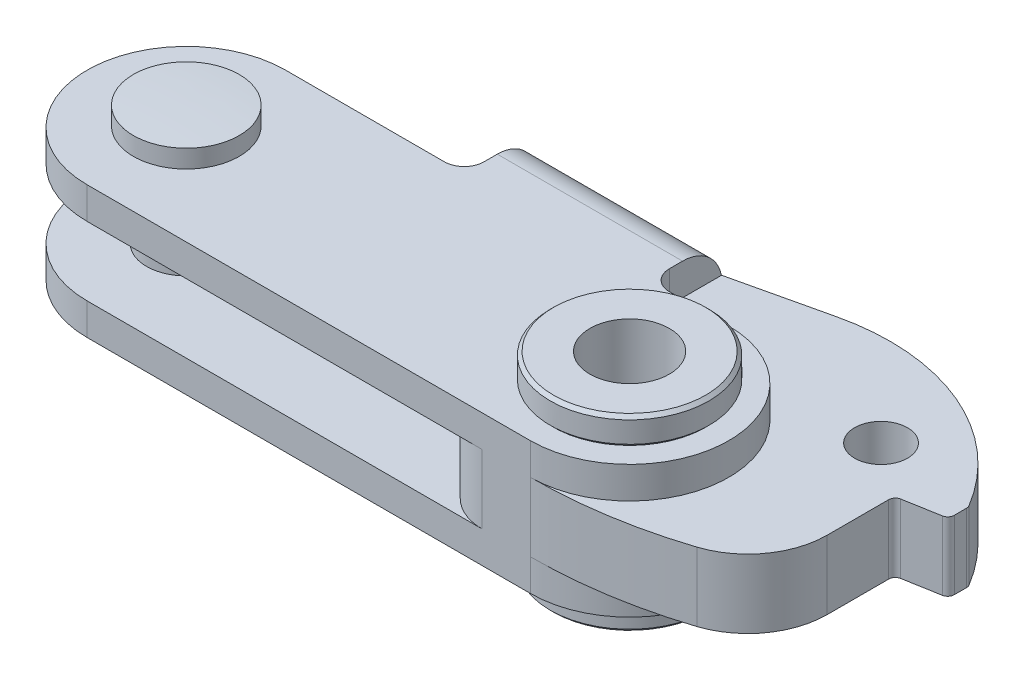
ISO-10303-21;
HEADER;
FILE_DESCRIPTION(('STEP AP214'),'2;1');
FILE_NAME('part.step','',(''),(''),'','','');
FILE_SCHEMA(('AUTOMOTIVE_DESIGN { 1 0 10303 214 1 1 1 1 }'));
ENDSEC;
DATA;
#1=APPLICATION_CONTEXT('core data for automotive mechanical design processes');
#2=APPLICATION_PROTOCOL_DEFINITION('international standard','automotive_design',2000,#1);
#3=PRODUCT_CONTEXT('',#1,'mechanical');
#4=PRODUCT('Part','Part','',(#3));
#5=PRODUCT_RELATED_PRODUCT_CATEGORY('part','',(#4));
#6=PRODUCT_DEFINITION_FORMATION('','',#4);
#7=PRODUCT_DEFINITION_CONTEXT('part definition',#1,'design');
#8=PRODUCT_DEFINITION('design','',#6,#7);
#9=PRODUCT_DEFINITION_SHAPE('','',#8);
#10=(LENGTH_UNIT() NAMED_UNIT(*) SI_UNIT(.MILLI.,.METRE.));
#11=(NAMED_UNIT(*) PLANE_ANGLE_UNIT() SI_UNIT($,.RADIAN.));
#12=(NAMED_UNIT(*) SI_UNIT($,.STERADIAN.) SOLID_ANGLE_UNIT());
#13=UNCERTAINTY_MEASURE_WITH_UNIT(LENGTH_MEASURE(1.E-05),#10,'distance_accuracy_value','');
#14=(GEOMETRIC_REPRESENTATION_CONTEXT(3) GLOBAL_UNCERTAINTY_ASSIGNED_CONTEXT((#13)) GLOBAL_UNIT_ASSIGNED_CONTEXT((#10,
#11,#12)) REPRESENTATION_CONTEXT('',''));
#15=CARTESIAN_POINT('',(0.,0.,0.));
#16=DIRECTION('',(0.,0.,1.));
#17=DIRECTION('',(1.,0.,0.));
#18=AXIS2_PLACEMENT_3D('',#15,#16,#17);
#19=CARTESIAN_POINT('',(12.0000000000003,-5.,-8.99999999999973));
#20=DIRECTION('',(0.,1.,0.));
#21=DIRECTION('',(0.,0.,1.));
#22=AXIS2_PLACEMENT_3D('',#19,#20,#21);
#23=CYLINDRICAL_SURFACE('',#22,1.49999999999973);
#24=DIRECTION('',(0.,1.,0.));
#25=VECTOR('',#24,1.);
#26=CARTESIAN_POINT('',(13.5,-5.,-9.));
#27=LINE('',#26,#25);
#28=CARTESIAN_POINT('',(13.5,2.6,-8.99999999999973));
#29=VERTEX_POINT('',#28);
#30=CARTESIAN_POINT('',(13.5,5.,-9.));
#31=VERTEX_POINT('',#30);
#32=EDGE_CURVE('E606',#29,#31,#27,.T.);
#33=ORIENTED_EDGE('',*,*,#32,.F.);
#34=CARTESIAN_POINT('',(12.0000000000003,2.6,-8.99999999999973));
#35=DIRECTION('',(0.,1.,0.));
#36=DIRECTION('',(1.,0.,0.));
#37=AXIS2_PLACEMENT_3D('',#34,#35,#36);
#38=CIRCLE('',#37,1.49999999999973);
#39=CARTESIAN_POINT('',(12.,2.6,-7.5));
#40=VERTEX_POINT('',#39);
#41=EDGE_CURVE('E400',#40,#29,#38,.T.);
#42=ORIENTED_EDGE('',*,*,#41,.F.);
#43=DIRECTION('',(0.,1.,0.));
#44=VECTOR('',#43,1.);
#45=CARTESIAN_POINT('',(12.,-5.,-7.5));
#46=LINE('',#45,#44);
#47=CARTESIAN_POINT('',(12.,5.,-7.5));
#48=VERTEX_POINT('',#47);
#49=EDGE_CURVE('E602',#40,#48,#46,.T.);
#50=ORIENTED_EDGE('',*,*,#49,.T.);
#51=CARTESIAN_POINT('',(12.0000000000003,5.,-8.99999999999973));
#52=DIRECTION('',(0.,-1.,0.));
#53=DIRECTION('',(0.,0.,-1.));
#54=AXIS2_PLACEMENT_3D('',#51,#52,#53);
#55=CIRCLE('',#54,1.49999999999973);
#56=EDGE_CURVE('E526',#31,#48,#55,.T.);
#57=ORIENTED_EDGE('',*,*,#56,.F.);
#58=EDGE_LOOP('',(#33,#42,#50,#57));
#59=FACE_BOUND('',#58,.T.);
#60=ADVANCED_FACE('F14',(#59),#23,.F.);
#61=CARTESIAN_POINT('',(12.,-5.,-7.5));
#62=DIRECTION('',(0.,0.,-1.));
#63=DIRECTION('',(0.,1.,0.));
#64=AXIS2_PLACEMENT_3D('',#61,#62,#63);
#65=PLANE('',#64);
#66=ORIENTED_EDGE('',*,*,#49,.F.);
#67=DIRECTION('',(1.,0.,0.));
#68=VECTOR('',#67,1.);
#69=CARTESIAN_POINT('',(0.,2.6,-7.5));
#70=LINE('',#69,#68);
#71=CARTESIAN_POINT('',(0.,2.6,-7.5));
#72=VERTEX_POINT('',#71);
#73=EDGE_CURVE('E424',#72,#40,#70,.T.);
#74=ORIENTED_EDGE('',*,*,#73,.F.);
#75=DIRECTION('',(0.,1.,0.));
#76=VECTOR('',#75,1.);
#77=CARTESIAN_POINT('',(0.,-5.,-7.5));
#78=LINE('',#77,#76);
#79=CARTESIAN_POINT('',(0.,5.,-7.5));
#80=VERTEX_POINT('',#79);
#81=EDGE_CURVE('E598',#72,#80,#78,.T.);
#82=ORIENTED_EDGE('',*,*,#81,.T.);
#83=DIRECTION('',(-1.,0.,0.));
#84=VECTOR('',#83,1.);
#85=CARTESIAN_POINT('',(12.,5.,-7.5));
#86=LINE('',#85,#84);
#87=EDGE_CURVE('E529',#48,#80,#86,.T.);
#88=ORIENTED_EDGE('',*,*,#87,.F.);
#89=EDGE_LOOP('',(#66,#74,#82,#88));
#90=FACE_BOUND('',#89,.T.);
#91=ADVANCED_FACE('F718',(#90),#65,.T.);
#92=CARTESIAN_POINT('',(0.,-5.,0.));
#93=DIRECTION('',(0.,1.,0.));
#94=DIRECTION('',(0.,0.,1.));
#95=AXIS2_PLACEMENT_3D('',#92,#93,#94);
#96=CYLINDRICAL_SURFACE('',#95,7.5);
#97=ORIENTED_EDGE('',*,*,#81,.F.);
#98=CARTESIAN_POINT('',(0.,2.6,0.));
#99=DIRECTION('',(0.,-1.,0.));
#100=DIRECTION('',(1.,0.,0.));
#101=AXIS2_PLACEMENT_3D('',#98,#99,#100);
#102=CIRCLE('',#101,7.5);
#103=CARTESIAN_POINT('',(0.,2.6,7.5));
#104=VERTEX_POINT('',#103);
#105=EDGE_CURVE('E422',#104,#72,#102,.T.);
#106=ORIENTED_EDGE('',*,*,#105,.F.);
#107=DIRECTION('',(0.,1.,0.));
#108=VECTOR('',#107,1.);
#109=CARTESIAN_POINT('',(0.,-5.,7.5));
#110=LINE('',#109,#108);
#111=CARTESIAN_POINT('',(0.,5.,7.5));
#112=VERTEX_POINT('',#111);
#113=EDGE_CURVE('E593',#104,#112,#110,.T.);
#114=ORIENTED_EDGE('',*,*,#113,.T.);
#115=CARTESIAN_POINT('',(0.,5.,0.));
#116=DIRECTION('',(0.,1.,0.));
#117=DIRECTION('',(0.,0.,-1.));
#118=AXIS2_PLACEMENT_3D('',#115,#116,#117);
#119=CIRCLE('',#118,7.5);
#120=EDGE_CURVE('E532',#80,#112,#119,.T.);
#121=ORIENTED_EDGE('',*,*,#120,.F.);
#122=EDGE_LOOP('',(#97,#106,#114,#121));
#123=FACE_BOUND('',#122,.T.);
#124=ADVANCED_FACE('F726',(#123),#96,.T.);
#125=CARTESIAN_POINT('',(0.,-5.,7.5));
#126=DIRECTION('',(0.,0.,1.));
#127=DIRECTION('',(0.,-1.,0.));
#128=AXIS2_PLACEMENT_3D('',#125,#126,#127);
#129=PLANE('',#128);
#130=DIRECTION('',(-1.,0.,0.));
#131=VECTOR('',#130,1.);
#132=CARTESIAN_POINT('',(29.8568542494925,2.6,7.5));
#133=LINE('',#132,#131);
#134=CARTESIAN_POINT('',(29.8568542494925,2.6,7.5));
#135=VERTEX_POINT('',#134);
#136=EDGE_CURVE('E420',#135,#104,#133,.T.);
#137=ORIENTED_EDGE('',*,*,#136,.F.);
#138=DIRECTION('',(0.,-1.,0.));
#139=VECTOR('',#138,1.);
#140=CARTESIAN_POINT('',(29.8568542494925,0.,7.5));
#141=LINE('',#140,#139);
#142=CARTESIAN_POINT('',(29.8568542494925,-2.6,7.5));
#143=VERTEX_POINT('',#142);
#144=EDGE_CURVE('E676',#135,#143,#141,.T.);
#145=ORIENTED_EDGE('',*,*,#144,.T.);
#146=DIRECTION('',(1.,0.,0.));
#147=VECTOR('',#146,1.);
#148=CARTESIAN_POINT('',(0.,-2.6,7.5));
#149=LINE('',#148,#147);
#150=CARTESIAN_POINT('',(0.,-2.6,7.5));
#151=VERTEX_POINT('',#150);
#152=EDGE_CURVE('E452',#151,#143,#149,.T.);
#153=ORIENTED_EDGE('',*,*,#152,.F.);
#154=CARTESIAN_POINT('',(0.,-5.,7.5));
#155=VERTEX_POINT('',#154);
#156=EDGE_CURVE('E595',#155,#151,#110,.T.);
#157=ORIENTED_EDGE('',*,*,#156,.F.);
#158=DIRECTION('',(1.,0.,0.));
#159=VECTOR('',#158,1.);
#160=CARTESIAN_POINT('',(0.,-5.,7.5));
#161=LINE('',#160,#159);
#162=CARTESIAN_POINT('',(33.5,-5.,7.5));
#163=VERTEX_POINT('',#162);
#164=EDGE_CURVE('E561',#155,#163,#161,.T.);
#165=ORIENTED_EDGE('',*,*,#164,.T.);
#166=DIRECTION('',(0.,1.,0.));
#167=VECTOR('',#166,1.);
#168=CARTESIAN_POINT('',(33.5,-5.,7.5));
#169=LINE('',#168,#167);
#170=CARTESIAN_POINT('',(33.5,-2.6,7.5));
#171=VERTEX_POINT('',#170);
#172=EDGE_CURVE('E590',#163,#171,#169,.T.);
#173=ORIENTED_EDGE('',*,*,#172,.T.);
#174=CARTESIAN_POINT('',(33.5,2.6,7.5));
#175=VERTEX_POINT('',#174);
#176=EDGE_CURVE('E594',#171,#175,#169,.T.);
#177=ORIENTED_EDGE('',*,*,#176,.T.);
#178=CARTESIAN_POINT('',(33.5,5.,7.5));
#179=VERTEX_POINT('',#178);
#180=EDGE_CURVE('E589',#175,#179,#169,.T.);
#181=ORIENTED_EDGE('',*,*,#180,.T.);
#182=DIRECTION('',(1.,0.,0.));
#183=VECTOR('',#182,1.);
#184=CARTESIAN_POINT('',(0.,5.,7.5));
#185=LINE('',#184,#183);
#186=EDGE_CURVE('E535',#112,#179,#185,.T.);
#187=ORIENTED_EDGE('',*,*,#186,.F.);
#188=ORIENTED_EDGE('',*,*,#113,.F.);
#189=EDGE_LOOP('',(#137,#145,#153,#157,#165,#173,#177,#181,#187,#188));
#190=FACE_BOUND('',#189,.T.);
#191=ADVANCED_FACE('F759',(#190),#129,.T.);
#192=ORIENTED_EDGE('',*,*,#156,.T.);
#193=CARTESIAN_POINT('',(0.,-2.6,0.));
#194=DIRECTION('',(0.,1.,0.));
#195=DIRECTION('',(0.,0.,1.));
#196=AXIS2_PLACEMENT_3D('',#193,#194,#195);
#197=CIRCLE('',#196,7.5);
#198=CARTESIAN_POINT('',(0.,-2.6,-7.5));
#199=VERTEX_POINT('',#198);
#200=EDGE_CURVE('E450',#199,#151,#197,.T.);
#201=ORIENTED_EDGE('',*,*,#200,.F.);
#202=CARTESIAN_POINT('',(0.,-5.,-7.5));
#203=VERTEX_POINT('',#202);
#204=EDGE_CURVE('E599',#203,#199,#78,.T.);
#205=ORIENTED_EDGE('',*,*,#204,.F.);
#206=CARTESIAN_POINT('',(0.,-5.,0.));
#207=DIRECTION('',(0.,1.,0.));
#208=DIRECTION('',(0.,0.,-1.));
#209=AXIS2_PLACEMENT_3D('',#206,#207,#208);
#210=CIRCLE('',#209,7.5);
#211=EDGE_CURVE('E558',#203,#155,#210,.T.);
#212=ORIENTED_EDGE('',*,*,#211,.T.);
#213=EDGE_LOOP('',(#192,#201,#205,#212));
#214=FACE_BOUND('',#213,.T.);
#215=ADVANCED_FACE('F744',(#214),#96,.T.);
#216=ORIENTED_EDGE('',*,*,#204,.T.);
#217=DIRECTION('',(-1.,0.,0.));
#218=VECTOR('',#217,1.);
#219=CARTESIAN_POINT('',(12.,-2.6,-7.5));
#220=LINE('',#219,#218);
#221=CARTESIAN_POINT('',(12.,-2.6,-7.5));
#222=VERTEX_POINT('',#221);
#223=EDGE_CURVE('E448',#222,#199,#220,.T.);
#224=ORIENTED_EDGE('',*,*,#223,.F.);
#225=CARTESIAN_POINT('',(12.,-5.,-7.5));
#226=VERTEX_POINT('',#225);
#227=EDGE_CURVE('E603',#226,#222,#46,.T.);
#228=ORIENTED_EDGE('',*,*,#227,.F.);
#229=DIRECTION('',(-1.,0.,0.));
#230=VECTOR('',#229,1.);
#231=CARTESIAN_POINT('',(12.,-5.,-7.5));
#232=LINE('',#231,#230);
#233=EDGE_CURVE('E555',#226,#203,#232,.T.);
#234=ORIENTED_EDGE('',*,*,#233,.T.);
#235=EDGE_LOOP('',(#216,#224,#228,#234));
#236=FACE_BOUND('',#235,.T.);
#237=ADVANCED_FACE('F729',(#236),#65,.T.);
#238=ORIENTED_EDGE('',*,*,#227,.T.);
#239=CARTESIAN_POINT('',(12.0000000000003,-2.6,-8.99999999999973));
#240=DIRECTION('',(0.,-1.,0.));
#241=DIRECTION('',(0.,0.,1.));
#242=AXIS2_PLACEMENT_3D('',#239,#240,#241);
#243=CIRCLE('',#242,1.49999999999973);
#244=CARTESIAN_POINT('',(13.5,-2.6,-9.));
#245=VERTEX_POINT('',#244);
#246=EDGE_CURVE('E446',#245,#222,#243,.T.);
#247=ORIENTED_EDGE('',*,*,#246,.F.);
#248=CARTESIAN_POINT('',(13.5,-5.,-9.));
#249=VERTEX_POINT('',#248);
#250=EDGE_CURVE('E607',#249,#245,#27,.T.);
#251=ORIENTED_EDGE('',*,*,#250,.F.);
#252=CARTESIAN_POINT('',(12.0000000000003,-5.,-8.99999999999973));
#253=DIRECTION('',(0.,-1.,0.));
#254=DIRECTION('',(0.,0.,-1.));
#255=AXIS2_PLACEMENT_3D('',#252,#253,#254);
#256=CIRCLE('',#255,1.49999999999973);
#257=EDGE_CURVE('E552',#249,#226,#256,.T.);
#258=ORIENTED_EDGE('',*,*,#257,.T.);
#259=EDGE_LOOP('',(#238,#247,#251,#258));
#260=FACE_BOUND('',#259,.T.);
#261=ADVANCED_FACE('F721',(#260),#23,.F.);
#262=CARTESIAN_POINT('',(27.5,-5.,-9.));
#263=DIRECTION('',(1.,0.,0.));
#264=DIRECTION('',(0.,1.,0.));
#265=AXIS2_PLACEMENT_3D('',#262,#263,#264);
#266=PLANE('',#265);
#267=DIRECTION('',(0.,-1.,0.));
#268=VECTOR('',#267,1.);
#269=CARTESIAN_POINT('',(27.5,-5.,-12.950232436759));
#270=LINE('',#269,#268);
#271=CARTESIAN_POINT('',(27.5,2.54417696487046,-12.950232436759));
#272=VERTEX_POINT('',#271);
#273=CARTESIAN_POINT('',(27.5,-2.54417696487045,-12.950232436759));
#274=VERTEX_POINT('',#273);
#275=EDGE_CURVE('E620',#272,#274,#270,.T.);
#276=ORIENTED_EDGE('',*,*,#275,.T.);
#277=CARTESIAN_POINT('',(27.5,-2.00000000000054,-10.0000000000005));
#278=DIRECTION('',(-1.,0.,0.));
#279=DIRECTION('',(0.,0.,1.));
#280=AXIS2_PLACEMENT_3D('',#277,#278,#279);
#281=CIRCLE('',#280,2.99999999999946);
#282=CARTESIAN_POINT('',(27.5,-2.,-13.));
#283=VERTEX_POINT('',#282);
#284=EDGE_CURVE('E511',#283,#274,#281,.T.);
#285=ORIENTED_EDGE('',*,*,#284,.F.);
#286=DIRECTION('',(0.,1.,0.));
#287=VECTOR('',#286,1.);
#288=CARTESIAN_POINT('',(27.5,-5.,-13.));
#289=LINE('',#288,#287);
#290=CARTESIAN_POINT('',(27.5,2.,-13.));
#291=VERTEX_POINT('',#290);
#292=EDGE_CURVE('E575',#283,#291,#289,.T.);
#293=ORIENTED_EDGE('',*,*,#292,.T.);
#294=CARTESIAN_POINT('',(27.5,2.00000000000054,-10.0000000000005));
#295=DIRECTION('',(-1.,0.,0.));
#296=DIRECTION('',(0.,0.,1.));
#297=AXIS2_PLACEMENT_3D('',#294,#295,#296);
#298=CIRCLE('',#297,2.99999999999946);
#299=EDGE_CURVE('E507',#272,#291,#298,.T.);
#300=ORIENTED_EDGE('',*,*,#299,.F.);
#301=EDGE_LOOP('',(#276,#285,#293,#300));
#302=FACE_BOUND('',#301,.T.);
#303=ADVANCED_FACE('F733',(#302),#266,.T.);
#304=DIRECTION('',(0.,0.,-1.));
#305=VECTOR('',#304,1.);
#306=CARTESIAN_POINT('',(27.5,-2.6,-8.99999999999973));
#307=LINE('',#306,#305);
#308=CARTESIAN_POINT('',(27.5,-2.6,-9.));
#309=VERTEX_POINT('',#308);
#310=CARTESIAN_POINT('',(27.5,-2.6,-12.9393876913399));
#311=VERTEX_POINT('',#310);
#312=EDGE_CURVE('E34',#309,#311,#307,.T.);
#313=ORIENTED_EDGE('',*,*,#312,.F.);
#314=DIRECTION('',(0.,1.,0.));
#315=VECTOR('',#314,1.);
#316=CARTESIAN_POINT('',(27.5,-5.,-9.));
#317=LINE('',#316,#315);
#318=CARTESIAN_POINT('',(27.5,-5.,-9.));
#319=VERTEX_POINT('',#318);
#320=EDGE_CURVE('E579',#319,#309,#317,.T.);
#321=ORIENTED_EDGE('',*,*,#320,.F.);
#322=DIRECTION('',(0.,0.,-1.));
#323=VECTOR('',#322,1.);
#324=CARTESIAN_POINT('',(27.5,-5.,-9.));
#325=LINE('',#324,#323);
#326=CARTESIAN_POINT('',(27.5,-5.,-10.0000000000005));
#327=VERTEX_POINT('',#326);
#328=EDGE_CURVE('E573',#319,#327,#325,.T.);
#329=ORIENTED_EDGE('',*,*,#328,.T.);
#330=EDGE_CURVE('E29',#311,#327,#281,.T.);
#331=ORIENTED_EDGE('',*,*,#330,.F.);
#332=EDGE_LOOP('',(#313,#321,#329,#331));
#333=FACE_BOUND('',#332,.T.);
#334=ADVANCED_FACE('F740',(#333),#266,.T.);
#335=CARTESIAN_POINT('',(33.5,-5.,0.));
#336=DIRECTION('',(0.,-1.,0.));
#337=DIRECTION('',(0.,0.,1.));
#338=AXIS2_PLACEMENT_3D('',#335,#336,#337);
#339=CONICAL_SURFACE('',#338,5.8,0.785398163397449);
#340=CARTESIAN_POINT('',(33.5,-5.2,0.));
#341=DIRECTION('',(0.,-1.,0.));
#342=DIRECTION('',(0.,0.,1.));
#343=AXIS2_PLACEMENT_3D('',#340,#341,#342);
#344=CIRCLE('',#343,6.);
#345=CARTESIAN_POINT('',(33.5,-5.2,6.));
#346=VERTEX_POINT('',#345);
#347=EDGE_CURVE('E627',#346,#346,#344,.T.);
#348=ORIENTED_EDGE('',*,*,#347,.F.);
#349=EDGE_LOOP('',(#348));
#350=FACE_BOUND('',#349,.T.);
#351=CARTESIAN_POINT('',(33.5,-5.,0.));
#352=DIRECTION('',(0.,-1.,0.));
#353=DIRECTION('',(0.,0.,-1.));
#354=AXIS2_PLACEMENT_3D('',#351,#352,#353);
#355=CIRCLE('',#354,5.8);
#356=CARTESIAN_POINT('',(33.5,-5.,-5.8));
#357=VERTEX_POINT('',#356);
#358=EDGE_CURVE('E617',#357,#357,#355,.F.);
#359=ORIENTED_EDGE('',*,*,#358,.F.);
#360=EDGE_LOOP('',(#359));
#361=FACE_BOUND('',#360,.T.);
#362=ADVANCED_FACE('F1228',(#350,#361),#339,.T.);
#363=CARTESIAN_POINT('',(33.5,-5.,0.));
#364=DIRECTION('',(0.,-1.,0.));
#365=DIRECTION('',(0.,0.,1.));
#366=AXIS2_PLACEMENT_3D('',#363,#364,#365);
#367=CYLINDRICAL_SURFACE('',#366,6.);
#368=CARTESIAN_POINT('',(33.5,-6.85,0.));
#369=DIRECTION('',(0.,1.,0.));
#370=DIRECTION('',(0.,0.,1.));
#371=AXIS2_PLACEMENT_3D('',#368,#369,#370);
#372=CIRCLE('',#371,6.);
#373=CARTESIAN_POINT('',(33.5,-6.85,6.));
#374=VERTEX_POINT('',#373);
#375=EDGE_CURVE('E694',#374,#374,#372,.T.);
#376=ORIENTED_EDGE('',*,*,#375,.T.);
#377=EDGE_LOOP('',(#376));
#378=FACE_BOUND('',#377,.T.);
#379=ORIENTED_EDGE('',*,*,#347,.T.);
#380=EDGE_LOOP('',(#379));
#381=FACE_BOUND('',#380,.T.);
#382=ADVANCED_FACE('F1355',(#378,#381),#367,.T.);
#383=CARTESIAN_POINT('',(0.,-3.4452994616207,0.));
#384=DIRECTION('',(0.,1.,0.));
#385=DIRECTION('',(0.,0.,-1.));
#386=AXIS2_PLACEMENT_3D('',#383,#384,#385);
#387=CYLINDRICAL_SURFACE('',#386,3.);
#388=CARTESIAN_POINT('',(0.,-2.6,0.));
#389=DIRECTION('',(0.,1.,0.));
#390=DIRECTION('',(0.,0.,1.));
#391=AXIS2_PLACEMENT_3D('',#388,#389,#390);
#392=CIRCLE('',#391,3.);
#393=CARTESIAN_POINT('',(0.,-2.6,3.));
#394=VERTEX_POINT('',#393);
#395=EDGE_CURVE('E426',#394,#394,#392,.T.);
#396=ORIENTED_EDGE('',*,*,#395,.T.);
#397=EDGE_LOOP('',(#396));
#398=FACE_BOUND('',#397,.T.);
#399=CARTESIAN_POINT('',(0.,2.6,0.));
#400=DIRECTION('',(0.,-1.,0.));
#401=DIRECTION('',(1.,0.,0.));
#402=AXIS2_PLACEMENT_3D('',#399,#400,#401);
#403=CIRCLE('',#402,3.);
#404=CARTESIAN_POINT('',(3.,2.6,0.));
#405=VERTEX_POINT('',#404);
#406=EDGE_CURVE('E397',#405,#405,#403,.T.);
#407=ORIENTED_EDGE('',*,*,#406,.T.);
#408=EDGE_LOOP('',(#407));
#409=FACE_BOUND('',#408,.T.);
#410=ADVANCED_FACE('F930',(#398,#409),#387,.T.);
#411=CARTESIAN_POINT('',(0.,5.,0.));
#412=DIRECTION('',(0.,1.,0.));
#413=DIRECTION('',(0.,0.,1.));
#414=AXIS2_PLACEMENT_3D('',#411,#412,#413);
#415=CIRCLE('',#414,3.);
#416=CARTESIAN_POINT('',(0.,5.,3.));
#417=VERTEX_POINT('',#416);
#418=EDGE_CURVE('E472',#417,#417,#415,.T.);
#419=ORIENTED_EDGE('',*,*,#418,.T.);
#420=EDGE_LOOP('',(#419));
#421=FACE_BOUND('',#420,.T.);
#422=CARTESIAN_POINT('',(0.,5.1,0.));
#423=DIRECTION('',(0.,1.,0.));
#424=DIRECTION('',(0.,0.,-1.));
#425=AXIS2_PLACEMENT_3D('',#422,#423,#424);
#426=CIRCLE('',#425,3.);
#427=CARTESIAN_POINT('',(0.,5.1,-3.));
#428=VERTEX_POINT('',#427);
#429=EDGE_CURVE('E652',#428,#428,#426,.T.);
#430=ORIENTED_EDGE('',*,*,#429,.F.);
#431=EDGE_LOOP('',(#430));
#432=FACE_BOUND('',#431,.T.);
#433=ADVANCED_FACE('F1294',(#421,#432),#387,.T.);
#434=CARTESIAN_POINT('',(-4.,5.1,0.));
#435=DIRECTION('',(0.,-1.,0.));
#436=DIRECTION('',(0.,0.,1.));
#437=AXIS2_PLACEMENT_3D('',#434,#435,#436);
#438=PLANE('',#437);
#439=ORIENTED_EDGE('',*,*,#429,.T.);
#440=EDGE_LOOP('',(#439));
#441=FACE_BOUND('',#440,.T.);
#442=CARTESIAN_POINT('',(0.,5.1,0.));
#443=DIRECTION('',(0.,1.,0.));
#444=DIRECTION('',(0.,0.,-1.));
#445=AXIS2_PLACEMENT_3D('',#442,#443,#444);
#446=CIRCLE('',#445,4.);
#447=CARTESIAN_POINT('',(0.,5.1,-4.));
#448=VERTEX_POINT('',#447);
#449=EDGE_CURVE('E655',#448,#448,#446,.T.);
#450=ORIENTED_EDGE('',*,*,#449,.F.);
#451=EDGE_LOOP('',(#450));
#452=FACE_BOUND('',#451,.T.);
#453=ADVANCED_FACE('F1298',(#441,#452),#438,.T.);
#454=CARTESIAN_POINT('',(0.,-3.4452994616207,0.));
#455=DIRECTION('',(0.,1.,0.));
#456=DIRECTION('',(0.,0.,-1.));
#457=AXIS2_PLACEMENT_3D('',#454,#455,#456);
#458=CYLINDRICAL_SURFACE('',#457,4.);
#459=ORIENTED_EDGE('',*,*,#449,.T.);
#460=EDGE_LOOP('',(#459));
#461=FACE_BOUND('',#460,.T.);
#462=CARTESIAN_POINT('',(0.,6.46651818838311,0.));
#463=DIRECTION('',(0.,1.,0.));
#464=DIRECTION('',(0.,0.,-1.));
#465=AXIS2_PLACEMENT_3D('',#462,#463,#464);
#466=CIRCLE('',#465,4.);
#467=CARTESIAN_POINT('',(0.,6.46651818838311,-4.));
#468=VERTEX_POINT('',#467);
#469=EDGE_CURVE('E635',#468,#468,#466,.T.);
#470=ORIENTED_EDGE('',*,*,#469,.F.);
#471=EDGE_LOOP('',(#470));
#472=FACE_BOUND('',#471,.T.);
#473=ADVANCED_FACE('F1310',(#461,#472),#458,.T.);
#474=CARTESIAN_POINT('',(1.17657619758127E-12,-53.4000000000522,0.));
#475=DIRECTION('',(0.,1.,0.));
#476=DIRECTION('',(-1.,0.,0.));
#477=AXIS2_PLACEMENT_3D('',#474,#475,#476);
#478=SPHERICAL_SURFACE('',#477,60.0000000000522);
#479=ORIENTED_EDGE('',*,*,#469,.T.);
#480=EDGE_LOOP('',(#479));
#481=FACE_BOUND('',#480,.T.);
#482=ADVANCED_FACE('F1229',(#481),#478,.T.);
#483=CARTESIAN_POINT('',(0.,-5.1,0.));
#484=DIRECTION('',(0.,1.,0.));
#485=DIRECTION('',(0.,0.,-1.));
#486=AXIS2_PLACEMENT_3D('',#483,#484,#485);
#487=CIRCLE('',#486,3.);
#488=CARTESIAN_POINT('',(0.,-5.1,-3.));
#489=VERTEX_POINT('',#488);
#490=EDGE_CURVE('E649',#489,#489,#487,.T.);
#491=ORIENTED_EDGE('',*,*,#490,.T.);
#492=EDGE_LOOP('',(#491));
#493=FACE_BOUND('',#492,.T.);
#494=CARTESIAN_POINT('',(0.,-5.,0.));
#495=DIRECTION('',(0.,1.,0.));
#496=DIRECTION('',(0.,0.,1.));
#497=AXIS2_PLACEMENT_3D('',#494,#495,#496);
#498=CIRCLE('',#497,3.);
#499=CARTESIAN_POINT('',(0.,-5.,3.));
#500=VERTEX_POINT('',#499);
#501=EDGE_CURVE('E475',#500,#500,#498,.T.);
#502=ORIENTED_EDGE('',*,*,#501,.F.);
#503=EDGE_LOOP('',(#502));
#504=FACE_BOUND('',#503,.T.);
#505=ADVANCED_FACE('F1285',(#493,#504),#387,.T.);
#506=CARTESIAN_POINT('',(-3.,-5.1,0.));
#507=DIRECTION('',(0.,1.,0.));
#508=DIRECTION('',(0.,0.,-1.));
#509=AXIS2_PLACEMENT_3D('',#506,#507,#508);
#510=PLANE('',#509);
#511=CARTESIAN_POINT('',(0.,-5.1,0.));
#512=DIRECTION('',(0.,1.,0.));
#513=DIRECTION('',(0.,0.,-1.));
#514=AXIS2_PLACEMENT_3D('',#511,#512,#513);
#515=CIRCLE('',#514,4.);
#516=CARTESIAN_POINT('',(0.,-5.1,-4.));
#517=VERTEX_POINT('',#516);
#518=EDGE_CURVE('E646',#517,#517,#515,.T.);
#519=ORIENTED_EDGE('',*,*,#518,.T.);
#520=EDGE_LOOP('',(#519));
#521=FACE_BOUND('',#520,.T.);
#522=ORIENTED_EDGE('',*,*,#490,.F.);
#523=EDGE_LOOP('',(#522));
#524=FACE_BOUND('',#523,.T.);
#525=ADVANCED_FACE('F1273',(#521,#524),#510,.T.);
#526=CARTESIAN_POINT('',(0.,-3.4452994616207,0.));
#527=DIRECTION('',(0.,1.,0.));
#528=DIRECTION('',(0.,0.,-1.));
#529=AXIS2_PLACEMENT_3D('',#526,#527,#528);
#530=CYLINDRICAL_SURFACE('',#529,4.);
#531=CARTESIAN_POINT('',(0.,-6.4665181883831,0.));
#532=DIRECTION('',(0.,1.,0.));
#533=DIRECTION('',(0.,0.,-1.));
#534=AXIS2_PLACEMENT_3D('',#531,#532,#533);
#535=CIRCLE('',#534,4.);
#536=CARTESIAN_POINT('',(-4.00000000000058,-6.4665181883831,0.));
#537=VERTEX_POINT('',#536);
#538=EDGE_CURVE('E643',#537,#537,#535,.T.);
#539=ORIENTED_EDGE('',*,*,#538,.T.);
#540=EDGE_LOOP('',(#539));
#541=FACE_BOUND('',#540,.T.);
#542=ORIENTED_EDGE('',*,*,#518,.F.);
#543=EDGE_LOOP('',(#542));
#544=FACE_BOUND('',#543,.T.);
#545=ADVANCED_FACE('F1261',(#541,#544),#530,.T.);
#546=CARTESIAN_POINT('',(7.69566702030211E-12,53.4000000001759,0.));
#547=DIRECTION('',(0.,1.,0.));
#548=DIRECTION('',(-1.,0.,0.));
#549=AXIS2_PLACEMENT_3D('',#546,#547,#548);
#550=SPHERICAL_SURFACE('',#549,60.0000000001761);
#551=CARTESIAN_POINT('',(0.,-6.5666574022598,0.));
#552=DIRECTION('',(0.,1.,0.));
#553=DIRECTION('',(0.,0.,-1.));
#554=AXIS2_PLACEMENT_3D('',#551,#552,#553);
#555=CIRCLE('',#554,2.);
#556=CARTESIAN_POINT('',(-2.00000000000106,-6.5666574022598,0.));
#557=VERTEX_POINT('',#556);
#558=EDGE_CURVE('E639',#557,#557,#555,.T.);
#559=CARTESIAN_POINT('',(-2.00000000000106,-6.5666574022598,0.));
#560=CARTESIAN_POINT('',(-2.02084880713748,-6.56596205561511,0.));
#561=CARTESIAN_POINT('',(-2.04169725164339,-6.56525583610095,0.));
#562=CARTESIAN_POINT('',(-2.083393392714,-6.56382165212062,0.));
#563=CARTESIAN_POINT('',(-2.10424108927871,-6.56309368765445,0.));
#564=CARTESIAN_POINT('',(-2.14593571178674,-6.56161601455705,0.));
#565=CARTESIAN_POINT('',(-2.16678263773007,-6.56086630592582,0.));
#566=CARTESIAN_POINT('',(-2.2084756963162,-6.55934514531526,0.));
#567=CARTESIAN_POINT('',(-2.22932182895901,-6.55857369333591,0.));
#568=CARTESIAN_POINT('',(-2.2710132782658,-6.55700904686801,0.));
#569=CARTESIAN_POINT('',(-2.29185859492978,-6.55621585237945,0.));
#570=CARTESIAN_POINT('',(-2.33354838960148,-6.55460772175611,0.));
#571=CARTESIAN_POINT('',(-2.3543928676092,-6.55379278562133,0.));
#572=CARTESIAN_POINT('',(-2.39608096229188,-6.55214117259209,0.));
#573=CARTESIAN_POINT('',(-2.41692457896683,-6.55130449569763,0.));
#574=CARTESIAN_POINT('',(-2.4586109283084,-6.54960940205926,0.));
#575=CARTESIAN_POINT('',(-2.47945366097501,-6.54875098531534,0.));
#576=CARTESIAN_POINT('',(-2.52113821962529,-6.5470124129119,0.));
#577=CARTESIAN_POINT('',(-2.54198004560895,-6.54613225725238,0.));
#578=CARTESIAN_POINT('',(-2.58366276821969,-6.54435020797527,0.));
#579=CARTESIAN_POINT('',(-2.60450366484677,-6.54344831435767,0.));
#580=CARTESIAN_POINT('',(-2.64618450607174,-6.54162279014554,0.));
#581=CARTESIAN_POINT('',(-2.66702445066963,-6.54069915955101,0.));
#582=CARTESIAN_POINT('',(-2.70870336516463,-6.53883016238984,0.));
#583=CARTESIAN_POINT('',(-2.72954233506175,-6.53788479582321,0.));
#584=CARTESIAN_POINT('',(-2.77121927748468,-6.53597232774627,0.));
#585=CARTESIAN_POINT('',(-2.7920572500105,-6.53500522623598,0.));
#586=CARTESIAN_POINT('',(-2.83373217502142,-6.53304928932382,0.));
#587=CARTESIAN_POINT('',(-2.85456912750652,-6.53206045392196,0.));
#588=CARTESIAN_POINT('',(-2.89624198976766,-6.53006105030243,0.));
#589=CARTESIAN_POINT('',(-2.91707789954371,-6.52905048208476,0.));
#590=CARTESIAN_POINT('',(-2.95874865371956,-6.52700761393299,0.));
#591=CARTESIAN_POINT('',(-2.97958349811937,-6.52597531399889,0.));
#592=CARTESIAN_POINT('',(-3.02125209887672,-6.5238889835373,0.));
#593=CARTESIAN_POINT('',(-3.04208585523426,-6.5228349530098,0.));
#594=CARTESIAN_POINT('',(-3.08375225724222,-6.52070516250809,0.));
#595=CARTESIAN_POINT('',(-3.10458490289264,-6.51962940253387,0.));
#596=CARTESIAN_POINT('',(-3.14624906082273,-6.517456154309,0.));
#597=CARTESIAN_POINT('',(-3.16708057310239,-6.51635866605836,0.));
#598=CARTESIAN_POINT('',(-3.20874244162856,-6.51414196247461,0.));
#599=CARTESIAN_POINT('',(-3.22957279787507,-6.51302274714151,0.));
#600=CARTESIAN_POINT('',(-3.27123233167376,-6.5107625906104,0.));
#601=CARTESIAN_POINT('',(-3.29206150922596,-6.5096216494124,0.));
#602=CARTESIAN_POINT('',(-3.33371866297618,-6.50731804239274,0.));
#603=CARTESIAN_POINT('',(-3.3545466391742,-6.50615537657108,0.));
#604=CARTESIAN_POINT('',(-3.39620136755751,-6.50380832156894,0.));
#605=CARTESIAN_POINT('',(-3.41702811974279,-6.50262393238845,0.));
#606=CARTESIAN_POINT('',(-3.4586803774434,-6.50023343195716,0.));
#607=CARTESIAN_POINT('',(-3.47950588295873,-6.49902732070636,0.));
#608=CARTESIAN_POINT('',(-3.52115562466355,-6.49659337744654,0.));
#609=CARTESIAN_POINT('',(-3.54197986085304,-6.49536554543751,0.));
#610=CARTESIAN_POINT('',(-3.5836270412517,-6.49288816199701,0.));
#611=CARTESIAN_POINT('',(-3.60444998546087,-6.49163861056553,0.));
#612=CARTESIAN_POINT('',(-3.64609455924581,-6.48911778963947,0.));
#613=CARTESIAN_POINT('',(-3.66691618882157,-6.48784652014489,0.));
#614=CARTESIAN_POINT('',(-3.70855811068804,-6.48528226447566,0.));
#615=CARTESIAN_POINT('',(-3.72937840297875,-6.48398927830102,0.));
#616=CARTESIAN_POINT('',(-3.77101762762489,-6.48138159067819,0.));
#617=CARTESIAN_POINT('',(-3.79183655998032,-6.48006688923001,0.));
#618=CARTESIAN_POINT('',(-3.83347304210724,-6.47741577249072,0.));
#619=CARTESIAN_POINT('',(-3.85429059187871,-6.47607935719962,0.));
#620=CARTESIAN_POINT('',(-3.8959242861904,-6.47338481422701,0.));
#621=CARTESIAN_POINT('',(-3.9167404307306,-6.47202668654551,0.));
#622=CARTESIAN_POINT('',(-3.9583712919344,-6.4692887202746,0.));
#623=CARTESIAN_POINT('',(-3.97918600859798,-6.4679088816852,0.));
#624=CARTESIAN_POINT('',(-4.00000000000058,-6.4665181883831,0.));
#625=B_SPLINE_CURVE_WITH_KNOTS('',3,(#559,#560,#561,#562,#563,#564,#565,#566,#567,#568,#569,
#570,#571,#572,#573,#574,#575,#576,#577,#578,#579,#580,#581,#582,#583,#584,#585,#586,#587,#588,
#589,#590,#591,#592,#593,#594,#595,#596,#597,#598,#599,#600,#601,#602,#603,#604,#605,#606,#607,
#608,#609,#610,#611,#612,#613,#614,#615,#616,#617,#618,#619,#620,#621,#622,#623,#624),
.UNSPECIFIED.,.F.,.F.,(4,2,2,2,2,2,2,2,2,2,2,2,2,2,2,2,2,2,2,2,2,2,2,2,2,2,2,2,2,2,2,2,4),(0.,
0.0625811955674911,0.12516239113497,0.187743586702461,0.250324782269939,0.31290597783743,
0.375487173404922,0.4380683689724,0.500649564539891,0.563230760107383,0.625811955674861,
0.688393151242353,0.750974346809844,0.813555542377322,0.876136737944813,0.938717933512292,
1.00129912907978,1.06388032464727,1.12646152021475,1.18904271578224,1.25162391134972,
1.31420510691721,1.37678630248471,1.43936749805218,1.50194869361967,1.56452988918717,
1.62711108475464,1.68969228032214,1.75227347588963,1.81485467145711,1.8774358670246,
1.94001706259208,2.00259825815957),.UNSPECIFIED.);
#626=EDGE_CURVE('BSEAM1249',#557,#537,#625,.T.);
#627=ORIENTED_EDGE('',*,*,#558,.T.);
#628=ORIENTED_EDGE('',*,*,#538,.F.);
#629=ORIENTED_EDGE('',*,*,#626,.T.);
#630=ORIENTED_EDGE('',*,*,#626,.F.);
#631=EDGE_LOOP('',(#627,#629,#628,#630));
#632=FACE_BOUND('',#631,.T.);
#633=ADVANCED_FACE('F1249',(#632),#550,.T.);
#634=CARTESIAN_POINT('',(0.,-3.4452994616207,0.));
#635=DIRECTION('',(0.,1.,0.));
#636=DIRECTION('',(0.,0.,-1.));
#637=AXIS2_PLACEMENT_3D('',#634,#635,#636);
#638=CYLINDRICAL_SURFACE('',#637,2.);
#639=CARTESIAN_POINT('',(0.,-4.6,0.));
#640=DIRECTION('',(0.,1.,0.));
#641=DIRECTION('',(0.,0.,-1.));
#642=AXIS2_PLACEMENT_3D('',#639,#640,#641);
#643=CIRCLE('',#642,2.);
#644=CARTESIAN_POINT('',(0.,-4.6,-2.));
#645=VERTEX_POINT('',#644);
#646=EDGE_CURVE('E636',#645,#645,#643,.T.);
#647=ORIENTED_EDGE('',*,*,#646,.T.);
#648=EDGE_LOOP('',(#647));
#649=FACE_BOUND('',#648,.T.);
#650=ORIENTED_EDGE('',*,*,#558,.F.);
#651=EDGE_LOOP('',(#650));
#652=FACE_BOUND('',#651,.T.);
#653=ADVANCED_FACE('F1239',(#649,#652),#638,.F.);
#654=CARTESIAN_POINT('',(0.,-4.6,0.));
#655=DIRECTION('',(0.,-1.,0.));
#656=DIRECTION('',(0.,0.,1.));
#657=AXIS2_PLACEMENT_3D('',#654,#655,#656);
#658=CONICAL_SURFACE('',#657,2.,1.04719755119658);
#659=CARTESIAN_POINT('',(0.,-3.4452994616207,0.));
#660=VERTEX_POINT('',#659);
#661=VERTEX_LOOP('',#660);
#662=FACE_BOUND('',#661,.T.);
#663=ORIENTED_EDGE('',*,*,#646,.F.);
#664=EDGE_LOOP('',(#663));
#665=FACE_BOUND('',#664,.T.);
#666=ADVANCED_FACE('F929',(#662,#665),#658,.F.);
#667=CARTESIAN_POINT('',(28.5,-1.99999999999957,-9.99999999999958));
#668=DIRECTION('',(-1.,0.,0.));
#669=DIRECTION('',(0.,-1.,0.));
#670=AXIS2_PLACEMENT_3D('',#667,#668,#669);
#671=CYLINDRICAL_SURFACE('',#670,0.500000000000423);
#672=CARTESIAN_POINT('',(27.49,-1.99999999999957,-9.99999999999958));
#673=DIRECTION('',(-1.,0.,0.));
#674=DIRECTION('',(0.,-1.,0.));
#675=AXIS2_PLACEMENT_3D('',#672,#673,#674);
#676=CIRCLE('',#675,0.500000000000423);
#677=CARTESIAN_POINT('',(27.49,-2.,-10.5));
#678=VERTEX_POINT('',#677);
#679=CARTESIAN_POINT('',(27.49,-2.5,-10.));
#680=VERTEX_POINT('',#679);
#681=EDGE_CURVE('E613',#678,#680,#676,.T.);
#682=ORIENTED_EDGE('',*,*,#681,.F.);
#683=DIRECTION('',(-1.,0.,0.));
#684=VECTOR('',#683,1.);
#685=CARTESIAN_POINT('',(28.5,-2.,-10.5));
#686=LINE('',#685,#684);
#687=CARTESIAN_POINT('',(13.5,-2.,-10.5));
#688=VERTEX_POINT('',#687);
#689=EDGE_CURVE('E479',#678,#688,#686,.T.);
#690=ORIENTED_EDGE('',*,*,#689,.T.);
#691=CARTESIAN_POINT('',(13.5,-1.99999999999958,-9.99999999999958));
#692=DIRECTION('',(-1.,0.,0.));
#693=DIRECTION('',(0.,-1.,0.));
#694=AXIS2_PLACEMENT_3D('',#691,#692,#693);
#695=CIRCLE('',#694,0.500000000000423);
#696=CARTESIAN_POINT('',(13.5,-2.5,-10.));
#697=VERTEX_POINT('',#696);
#698=EDGE_CURVE('E490',#697,#688,#695,.F.);
#699=ORIENTED_EDGE('',*,*,#698,.F.);
#700=DIRECTION('',(-1.,0.,0.));
#701=VECTOR('',#700,1.);
#702=CARTESIAN_POINT('',(28.5,-2.5,-10.));
#703=LINE('',#702,#701);
#704=CARTESIAN_POINT('',(15.5,-2.5,-10.));
#705=VERTEX_POINT('',#704);
#706=EDGE_CURVE('E481',#705,#697,#703,.T.);
#707=ORIENTED_EDGE('',*,*,#706,.F.);
#708=EDGE_CURVE('E483',#680,#705,#703,.T.);
#709=ORIENTED_EDGE('',*,*,#708,.F.);
#710=EDGE_LOOP('',(#682,#690,#699,#707,#709));
#711=FACE_BOUND('',#710,.T.);
#712=ADVANCED_FACE('F789',(#711),#671,.F.);
#713=CARTESIAN_POINT('',(12.0000000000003,-5.,-8.99999999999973));
#714=DIRECTION('',(0.,-1.,0.));
#715=DIRECTION('',(0.,0.,-1.));
#716=AXIS2_PLACEMENT_3D('',#713,#714,#715);
#717=PLANE('',#716);
#718=DIRECTION('',(-1.,0.,0.));
#719=VECTOR('',#718,1.);
#720=CARTESIAN_POINT('',(27.5,-5.,-10.));
#721=LINE('',#720,#719);
#722=CARTESIAN_POINT('',(13.5,-5.,-10.));
#723=VERTEX_POINT('',#722);
#724=EDGE_CURVE('E513',#327,#723,#721,.T.);
#725=ORIENTED_EDGE('',*,*,#724,.F.);
#726=ORIENTED_EDGE('',*,*,#328,.F.);
#727=CARTESIAN_POINT('',(29.,-5.,-8.99999999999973));
#728=DIRECTION('',(0.,-1.,0.));
#729=DIRECTION('',(0.,0.,1.));
#730=AXIS2_PLACEMENT_3D('',#727,#728,#729);
#731=CIRCLE('',#730,1.49999999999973);
#732=CARTESIAN_POINT('',(29.,-5.,-7.5));
#733=VERTEX_POINT('',#732);
#734=EDGE_CURVE('E570',#733,#319,#731,.T.);
#735=ORIENTED_EDGE('',*,*,#734,.F.);
#736=DIRECTION('',(-1.,0.,0.));
#737=VECTOR('',#736,1.);
#738=CARTESIAN_POINT('',(33.5,-5.,-7.5));
#739=LINE('',#738,#737);
#740=CARTESIAN_POINT('',(33.5,-5.,-7.5));
#741=VERTEX_POINT('',#740);
#742=EDGE_CURVE('E567',#741,#733,#739,.T.);
#743=ORIENTED_EDGE('',*,*,#742,.F.);
#744=CARTESIAN_POINT('',(33.5,-5.,0.));
#745=DIRECTION('',(0.,1.,0.));
#746=DIRECTION('',(0.,0.,1.));
#747=AXIS2_PLACEMENT_3D('',#744,#745,#746);
#748=CIRCLE('',#747,7.5);
#749=EDGE_CURVE('E564',#163,#741,#748,.T.);
#750=ORIENTED_EDGE('',*,*,#749,.F.);
#751=ORIENTED_EDGE('',*,*,#164,.F.);
#752=ORIENTED_EDGE('',*,*,#211,.F.);
#753=ORIENTED_EDGE('',*,*,#233,.F.);
#754=ORIENTED_EDGE('',*,*,#257,.F.);
#755=DIRECTION('',(0.,0.,1.));
#756=VECTOR('',#755,1.);
#757=CARTESIAN_POINT('',(13.5,-5.,-13.));
#758=LINE('',#757,#756);
#759=EDGE_CURVE('E550',#723,#249,#758,.T.);
#760=ORIENTED_EDGE('',*,*,#759,.F.);
#761=EDGE_LOOP('',(#725,#726,#735,#743,#750,#751,#752,#753,#754,#760));
#762=FACE_BOUND('',#761,.T.);
#763=ORIENTED_EDGE('',*,*,#501,.T.);
#764=EDGE_LOOP('',(#763));
#765=FACE_BOUND('',#764,.T.);
#766=ORIENTED_EDGE('',*,*,#358,.T.);
#767=EDGE_LOOP('',(#766));
#768=FACE_BOUND('',#767,.T.);
#769=ADVANCED_FACE('F888',(#762,#765,#768),#717,.T.);
#770=CARTESIAN_POINT('',(27.5,-2.00000000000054,-10.0000000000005));
#771=DIRECTION('',(-1.,0.,0.));
#772=DIRECTION('',(0.,-1.,0.));
#773=AXIS2_PLACEMENT_3D('',#770,#771,#772);
#774=CYLINDRICAL_SURFACE('',#773,2.99999999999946);
#775=CARTESIAN_POINT('',(13.5,-2.00000000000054,-10.0000000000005));
#776=DIRECTION('',(-1.,0.,0.));
#777=DIRECTION('',(0.,0.,1.));
#778=AXIS2_PLACEMENT_3D('',#775,#776,#777);
#779=CIRCLE('',#778,2.99999999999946);
#780=CARTESIAN_POINT('',(13.5,-2.,-13.));
#781=VERTEX_POINT('',#780);
#782=EDGE_CURVE('E503',#781,#723,#779,.T.);
#783=ORIENTED_EDGE('',*,*,#782,.F.);
#784=DIRECTION('',(-1.,0.,0.));
#785=VECTOR('',#784,1.);
#786=CARTESIAN_POINT('',(27.5,-2.,-13.));
#787=LINE('',#786,#785);
#788=EDGE_CURVE('E515',#283,#781,#787,.T.);
#789=ORIENTED_EDGE('',*,*,#788,.F.);
#790=ORIENTED_EDGE('',*,*,#284,.T.);
#791=EDGE_CURVE('E295',#274,#311,#281,.T.);
#792=ORIENTED_EDGE('',*,*,#791,.T.);
#793=ORIENTED_EDGE('',*,*,#330,.T.);
#794=ORIENTED_EDGE('',*,*,#724,.T.);
#795=EDGE_LOOP('',(#783,#789,#790,#792,#793,#794));
#796=FACE_BOUND('',#795,.T.);
#797=ADVANCED_FACE('F884',(#796),#774,.T.);
#798=CARTESIAN_POINT('',(28.5,1.99999999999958,-9.99999999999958));
#799=DIRECTION('',(-1.,0.,0.));
#800=DIRECTION('',(0.,-1.,0.));
#801=AXIS2_PLACEMENT_3D('',#798,#799,#800);
#802=CYLINDRICAL_SURFACE('',#801,0.500000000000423);
#803=CARTESIAN_POINT('',(27.49,1.99999999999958,-9.99999999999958));
#804=DIRECTION('',(-1.,0.,0.));
#805=DIRECTION('',(0.,-1.,0.));
#806=AXIS2_PLACEMENT_3D('',#803,#804,#805);
#807=CIRCLE('',#806,0.500000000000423);
#808=CARTESIAN_POINT('',(27.49,2.5,-10.));
#809=VERTEX_POINT('',#808);
#810=CARTESIAN_POINT('',(27.49,2.,-10.5));
#811=VERTEX_POINT('',#810);
#812=EDGE_CURVE('E616',#809,#811,#807,.T.);
#813=ORIENTED_EDGE('',*,*,#812,.F.);
#814=DIRECTION('',(-1.,0.,0.));
#815=VECTOR('',#814,1.);
#816=CARTESIAN_POINT('',(28.5,2.5,-10.));
#817=LINE('',#816,#815);
#818=CARTESIAN_POINT('',(15.5,2.5,-10.));
#819=VERTEX_POINT('',#818);
#820=EDGE_CURVE('E487',#809,#819,#817,.T.);
#821=ORIENTED_EDGE('',*,*,#820,.T.);
#822=CARTESIAN_POINT('',(13.5,2.5,-10.));
#823=VERTEX_POINT('',#822);
#824=EDGE_CURVE('E484',#819,#823,#817,.T.);
#825=ORIENTED_EDGE('',*,*,#824,.T.);
#826=CARTESIAN_POINT('',(13.5,1.99999999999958,-9.99999999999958));
#827=DIRECTION('',(-1.,0.,0.));
#828=DIRECTION('',(0.,-1.,0.));
#829=AXIS2_PLACEMENT_3D('',#826,#827,#828);
#830=CIRCLE('',#829,0.500000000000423);
#831=CARTESIAN_POINT('',(13.5,2.,-10.5));
#832=VERTEX_POINT('',#831);
#833=EDGE_CURVE('E493',#832,#823,#830,.F.);
#834=ORIENTED_EDGE('',*,*,#833,.F.);
#835=DIRECTION('',(-1.,0.,0.));
#836=VECTOR('',#835,1.);
#837=CARTESIAN_POINT('',(28.5,2.,-10.5));
#838=LINE('',#837,#836);
#839=EDGE_CURVE('E488',#811,#832,#838,.T.);
#840=ORIENTED_EDGE('',*,*,#839,.F.);
#841=EDGE_LOOP('',(#813,#821,#825,#834,#840));
#842=FACE_BOUND('',#841,.T.);
#843=ADVANCED_FACE('F800',(#842),#802,.F.);
#844=CARTESIAN_POINT('',(12.0000000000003,5.,-8.99999999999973));
#845=DIRECTION('',(0.,-1.,0.));
#846=DIRECTION('',(0.,0.,-1.));
#847=AXIS2_PLACEMENT_3D('',#844,#845,#846);
#848=PLANE('',#847);
#849=DIRECTION('',(0.,0.,1.));
#850=VECTOR('',#849,1.);
#851=CARTESIAN_POINT('',(13.5,5.,-13.));
#852=LINE('',#851,#850);
#853=CARTESIAN_POINT('',(13.5,5.,-10.0000000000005));
#854=VERTEX_POINT('',#853);
#855=EDGE_CURVE('E523',#854,#31,#852,.T.);
#856=ORIENTED_EDGE('',*,*,#855,.T.);
#857=ORIENTED_EDGE('',*,*,#56,.T.);
#858=ORIENTED_EDGE('',*,*,#87,.T.);
#859=ORIENTED_EDGE('',*,*,#120,.T.);
#860=ORIENTED_EDGE('',*,*,#186,.T.);
#861=CARTESIAN_POINT('',(33.5,5.,0.));
#862=DIRECTION('',(0.,1.,0.));
#863=DIRECTION('',(0.,0.,1.));
#864=AXIS2_PLACEMENT_3D('',#861,#862,#863);
#865=CIRCLE('',#864,7.5);
#866=CARTESIAN_POINT('',(33.5,5.,-7.5));
#867=VERTEX_POINT('',#866);
#868=EDGE_CURVE('E538',#179,#867,#865,.T.);
#869=ORIENTED_EDGE('',*,*,#868,.T.);
#870=DIRECTION('',(-1.,0.,0.));
#871=VECTOR('',#870,1.);
#872=CARTESIAN_POINT('',(33.5,5.,-7.5));
#873=LINE('',#872,#871);
#874=CARTESIAN_POINT('',(29.,5.,-7.5));
#875=VERTEX_POINT('',#874);
#876=EDGE_CURVE('E541',#867,#875,#873,.T.);
#877=ORIENTED_EDGE('',*,*,#876,.T.);
#878=CARTESIAN_POINT('',(29.,5.,-8.99999999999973));
#879=DIRECTION('',(0.,-1.,0.));
#880=DIRECTION('',(0.,0.,1.));
#881=AXIS2_PLACEMENT_3D('',#878,#879,#880);
#882=CIRCLE('',#881,1.49999999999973);
#883=CARTESIAN_POINT('',(27.5,5.,-9.));
#884=VERTEX_POINT('',#883);
#885=EDGE_CURVE('E544',#875,#884,#882,.T.);
#886=ORIENTED_EDGE('',*,*,#885,.T.);
#887=DIRECTION('',(0.,0.,-1.));
#888=VECTOR('',#887,1.);
#889=CARTESIAN_POINT('',(27.5,5.,-9.));
#890=LINE('',#889,#888);
#891=CARTESIAN_POINT('',(27.5,5.,-10.));
#892=VERTEX_POINT('',#891);
#893=EDGE_CURVE('E547',#884,#892,#890,.T.);
#894=ORIENTED_EDGE('',*,*,#893,.T.);
#895=DIRECTION('',(-1.,0.,0.));
#896=VECTOR('',#895,1.);
#897=CARTESIAN_POINT('',(27.5,5.,-10.));
#898=LINE('',#897,#896);
#899=EDGE_CURVE('E520',#892,#854,#898,.T.);
#900=ORIENTED_EDGE('',*,*,#899,.T.);
#901=EDGE_LOOP('',(#856,#857,#858,#859,#860,#869,#877,#886,#894,#900));
#902=FACE_BOUND('',#901,.T.);
#903=ORIENTED_EDGE('',*,*,#418,.F.);
#904=EDGE_LOOP('',(#903));
#905=FACE_BOUND('',#904,.T.);
#906=CARTESIAN_POINT('',(33.5,5.,0.));
#907=DIRECTION('',(0.,1.,0.));
#908=DIRECTION('',(0.,0.,-1.));
#909=AXIS2_PLACEMENT_3D('',#906,#907,#908);
#910=CIRCLE('',#909,5.75);
#911=CARTESIAN_POINT('',(33.5,5.,-5.75));
#912=VERTEX_POINT('',#911);
#913=EDGE_CURVE('E623',#912,#912,#910,.T.);
#914=ORIENTED_EDGE('',*,*,#913,.F.);
#915=EDGE_LOOP('',(#914));
#916=FACE_BOUND('',#915,.T.);
#917=ADVANCED_FACE('F812',(#902,#905,#916),#848,.F.);
#918=CARTESIAN_POINT('',(13.5,-5.,-13.));
#919=DIRECTION('',(-1.,0.,0.));
#920=DIRECTION('',(0.,-1.,0.));
#921=AXIS2_PLACEMENT_3D('',#918,#919,#920);
#922=PLANE('',#921);
#923=DIRECTION('',(0.,-1.,0.));
#924=VECTOR('',#923,1.);
#925=CARTESIAN_POINT('',(13.5,2.55,-10.));
#926=LINE('',#925,#924);
#927=CARTESIAN_POINT('',(13.5,2.6,-10.));
#928=VERTEX_POINT('',#927);
#929=EDGE_CURVE('E462',#928,#823,#926,.T.);
#930=ORIENTED_EDGE('',*,*,#929,.F.);
#931=DIRECTION('',(0.,0.,-1.));
#932=VECTOR('',#931,1.);
#933=CARTESIAN_POINT('',(13.5,2.6,-8.99999999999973));
#934=LINE('',#933,#932);
#935=EDGE_CURVE('E402',#29,#928,#934,.T.);
#936=ORIENTED_EDGE('',*,*,#935,.F.);
#937=ORIENTED_EDGE('',*,*,#32,.T.);
#938=ORIENTED_EDGE('',*,*,#855,.F.);
#939=CARTESIAN_POINT('',(13.5,2.00000000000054,-10.0000000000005));
#940=DIRECTION('',(-1.,0.,0.));
#941=DIRECTION('',(0.,0.,1.));
#942=AXIS2_PLACEMENT_3D('',#939,#940,#941);
#943=CIRCLE('',#942,2.99999999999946);
#944=CARTESIAN_POINT('',(13.5,2.,-13.));
#945=VERTEX_POINT('',#944);
#946=EDGE_CURVE('E499',#854,#945,#943,.T.);
#947=ORIENTED_EDGE('',*,*,#946,.T.);
#948=DIRECTION('',(0.,1.,0.));
#949=VECTOR('',#948,1.);
#950=CARTESIAN_POINT('',(13.5,-5.,-13.));
#951=LINE('',#950,#949);
#952=EDGE_CURVE('E610',#781,#945,#951,.T.);
#953=ORIENTED_EDGE('',*,*,#952,.F.);
#954=ORIENTED_EDGE('',*,*,#782,.T.);
#955=ORIENTED_EDGE('',*,*,#759,.T.);
#956=ORIENTED_EDGE('',*,*,#250,.T.);
#957=DIRECTION('',(0.,0.,1.));
#958=VECTOR('',#957,1.);
#959=CARTESIAN_POINT('',(13.5,-2.6,-10.));
#960=LINE('',#959,#958);
#961=CARTESIAN_POINT('',(13.5,-2.6,-10.));
#962=VERTEX_POINT('',#961);
#963=EDGE_CURVE('E444',#962,#245,#960,.T.);
#964=ORIENTED_EDGE('',*,*,#963,.F.);
#965=DIRECTION('',(0.,1.,0.));
#966=VECTOR('',#965,1.);
#967=CARTESIAN_POINT('',(13.5,-2.55,-10.));
#968=LINE('',#967,#966);
#969=EDGE_CURVE('E467',#962,#697,#968,.T.);
#970=ORIENTED_EDGE('',*,*,#969,.T.);
#971=ORIENTED_EDGE('',*,*,#698,.T.);
#972=DIRECTION('',(0.,1.,0.));
#973=VECTOR('',#972,1.);
#974=CARTESIAN_POINT('',(13.5,-5.,-10.5));
#975=LINE('',#974,#973);
#976=EDGE_CURVE('E496',#688,#832,#975,.T.);
#977=ORIENTED_EDGE('',*,*,#976,.T.);
#978=ORIENTED_EDGE('',*,*,#833,.T.);
#979=EDGE_LOOP('',(#930,#936,#937,#938,#947,#953,#954,#955,#956,#964,#970,#971,#977,#978));
#980=FACE_BOUND('',#979,.T.);
#981=ADVANCED_FACE('F786',(#980),#922,.T.);
#982=CARTESIAN_POINT('',(33.5,-5.,0.));
#983=DIRECTION('',(0.,1.,0.));
#984=DIRECTION('',(0.,0.,1.));
#985=AXIS2_PLACEMENT_3D('',#982,#983,#984);
#986=CYLINDRICAL_SURFACE('',#985,7.5);
#987=CARTESIAN_POINT('',(33.5,2.6,0.));
#988=DIRECTION('',(0.,-1.,0.));
#989=DIRECTION('',(0.,0.,1.));
#990=AXIS2_PLACEMENT_3D('',#987,#988,#989);
#991=CIRCLE('',#990,7.5);
#992=CARTESIAN_POINT('',(33.5,2.6,-7.5));
#993=VERTEX_POINT('',#992);
#994=EDGE_CURVE('E373',#993,#175,#991,.T.);
#995=ORIENTED_EDGE('',*,*,#994,.F.);
#996=DIRECTION('',(0.,1.,0.));
#997=VECTOR('',#996,1.);
#998=CARTESIAN_POINT('',(33.5,-5.,-7.5));
#999=LINE('',#998,#997);
#1000=EDGE_CURVE('E585',#993,#867,#999,.T.);
#1001=ORIENTED_EDGE('',*,*,#1000,.T.);
#1002=ORIENTED_EDGE('',*,*,#868,.F.);
#1003=ORIENTED_EDGE('',*,*,#180,.F.);
#1004=EDGE_LOOP('',(#995,#1001,#1002,#1003));
#1005=FACE_BOUND('',#1004,.T.);
#1006=ADVANCED_FACE('F824',(#1005),#986,.T.);
#1007=CARTESIAN_POINT('',(33.5,-5.,-7.5));
#1008=DIRECTION('',(0.,0.,-1.));
#1009=DIRECTION('',(0.,1.,0.));
#1010=AXIS2_PLACEMENT_3D('',#1007,#1008,#1009);
#1011=PLANE('',#1010);
#1012=DIRECTION('',(1.,0.,0.));
#1013=VECTOR('',#1012,1.);
#1014=CARTESIAN_POINT('',(29.,2.6,-7.49999999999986));
#1015=LINE('',#1014,#1013);
#1016=CARTESIAN_POINT('',(29.,2.6,-7.5));
#1017=VERTEX_POINT('',#1016);
#1018=EDGE_CURVE('E370',#1017,#993,#1015,.T.);
#1019=ORIENTED_EDGE('',*,*,#1018,.F.);
#1020=DIRECTION('',(0.,1.,0.));
#1021=VECTOR('',#1020,1.);
#1022=CARTESIAN_POINT('',(29.,-5.,-7.5));
#1023=LINE('',#1022,#1021);
#1024=EDGE_CURVE('E581',#1017,#875,#1023,.T.);
#1025=ORIENTED_EDGE('',*,*,#1024,.T.);
#1026=ORIENTED_EDGE('',*,*,#876,.F.);
#1027=ORIENTED_EDGE('',*,*,#1000,.F.);
#1028=EDGE_LOOP('',(#1019,#1025,#1026,#1027));
#1029=FACE_BOUND('',#1028,.T.);
#1030=ADVANCED_FACE('F947',(#1029),#1011,.T.);
#1031=CARTESIAN_POINT('',(29.,-5.,-8.99999999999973));
#1032=DIRECTION('',(0.,1.,0.));
#1033=DIRECTION('',(0.,0.,1.));
#1034=AXIS2_PLACEMENT_3D('',#1031,#1032,#1033);
#1035=CYLINDRICAL_SURFACE('',#1034,1.49999999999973);
#1036=CARTESIAN_POINT('',(29.,2.6,-8.99999999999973));
#1037=DIRECTION('',(0.,1.,0.));
#1038=DIRECTION('',(0.,0.,1.));
#1039=AXIS2_PLACEMENT_3D('',#1036,#1037,#1038);
#1040=CIRCLE('',#1039,1.49999999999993);
#1041=CARTESIAN_POINT('',(27.5,2.6,-9.));
#1042=VERTEX_POINT('',#1041);
#1043=EDGE_CURVE('E367',#1042,#1017,#1040,.T.);
#1044=ORIENTED_EDGE('',*,*,#1043,.F.);
#1045=EDGE_CURVE('E578',#1042,#884,#317,.T.);
#1046=ORIENTED_EDGE('',*,*,#1045,.T.);
#1047=ORIENTED_EDGE('',*,*,#885,.F.);
#1048=ORIENTED_EDGE('',*,*,#1024,.F.);
#1049=EDGE_LOOP('',(#1044,#1046,#1047,#1048));
#1050=FACE_BOUND('',#1049,.T.);
#1051=ADVANCED_FACE('F944',(#1050),#1035,.F.);
#1052=DIRECTION('',(0.,0.,1.));
#1053=VECTOR('',#1052,1.);
#1054=CARTESIAN_POINT('',(27.5,2.6,-12.950232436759));
#1055=LINE('',#1054,#1053);
#1056=CARTESIAN_POINT('',(27.5,2.6,-12.9393876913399));
#1057=VERTEX_POINT('',#1056);
#1058=EDGE_CURVE('E363',#1057,#1042,#1055,.T.);
#1059=ORIENTED_EDGE('',*,*,#1058,.F.);
#1060=EDGE_CURVE('E508',#892,#1057,#298,.T.);
#1061=ORIENTED_EDGE('',*,*,#1060,.F.);
#1062=ORIENTED_EDGE('',*,*,#893,.F.);
#1063=ORIENTED_EDGE('',*,*,#1045,.F.);
#1064=EDGE_LOOP('',(#1059,#1061,#1062,#1063));
#1065=FACE_BOUND('',#1064,.T.);
#1066=ADVANCED_FACE('F743',(#1065),#266,.T.);
#1067=CARTESIAN_POINT('',(27.5,2.00000000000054,-10.0000000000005));
#1068=DIRECTION('',(-1.,0.,0.));
#1069=DIRECTION('',(0.,-1.,0.));
#1070=AXIS2_PLACEMENT_3D('',#1067,#1068,#1069);
#1071=CYLINDRICAL_SURFACE('',#1070,2.99999999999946);
#1072=ORIENTED_EDGE('',*,*,#946,.F.);
#1073=ORIENTED_EDGE('',*,*,#899,.F.);
#1074=ORIENTED_EDGE('',*,*,#1060,.T.);
#1075=CARTESIAN_POINT('',(27.5,2.00000000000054,-10.0000000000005));
#1076=DIRECTION('',(1.,0.,0.));
#1077=DIRECTION('',(0.,1.,0.));
#1078=AXIS2_PLACEMENT_3D('',#1075,#1076,#1077);
#1079=CIRCLE('',#1078,2.99999999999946);
#1080=EDGE_CURVE('E459',#1057,#272,#1079,.F.);
#1081=ORIENTED_EDGE('',*,*,#1080,.T.);
#1082=ORIENTED_EDGE('',*,*,#299,.T.);
#1083=DIRECTION('',(-1.,0.,0.));
#1084=VECTOR('',#1083,1.);
#1085=CARTESIAN_POINT('',(27.5,2.,-13.));
#1086=LINE('',#1085,#1084);
#1087=EDGE_CURVE('E518',#291,#945,#1086,.T.);
#1088=ORIENTED_EDGE('',*,*,#1087,.T.);
#1089=EDGE_LOOP('',(#1072,#1073,#1074,#1081,#1082,#1088));
#1090=FACE_BOUND('',#1089,.T.);
#1091=ADVANCED_FACE('F876',(#1090),#1071,.T.);
#1092=CARTESIAN_POINT('',(29.,-2.6,-8.99999999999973));
#1093=DIRECTION('',(0.,-1.,0.));
#1094=DIRECTION('',(0.,0.,-1.));
#1095=AXIS2_PLACEMENT_3D('',#1092,#1093,#1094);
#1096=CIRCLE('',#1095,1.49999999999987);
#1097=CARTESIAN_POINT('',(29.,-2.6,-7.5));
#1098=VERTEX_POINT('',#1097);
#1099=EDGE_CURVE('E311',#1098,#309,#1096,.T.);
#1100=ORIENTED_EDGE('',*,*,#1099,.F.);
#1101=EDGE_CURVE('E582',#733,#1098,#1023,.T.);
#1102=ORIENTED_EDGE('',*,*,#1101,.F.);
#1103=ORIENTED_EDGE('',*,*,#734,.T.);
#1104=ORIENTED_EDGE('',*,*,#320,.T.);
#1105=EDGE_LOOP('',(#1100,#1102,#1103,#1104));
#1106=FACE_BOUND('',#1105,.T.);
#1107=ADVANCED_FACE('F898',(#1106),#1035,.F.);
#1108=DIRECTION('',(-1.,0.,0.));
#1109=VECTOR('',#1108,1.);
#1110=CARTESIAN_POINT('',(33.5,-2.6,-7.5));
#1111=LINE('',#1110,#1109);
#1112=CARTESIAN_POINT('',(33.5,-2.6,-7.5));
#1113=VERTEX_POINT('',#1112);
#1114=EDGE_CURVE('E348',#1113,#1098,#1111,.T.);
#1115=ORIENTED_EDGE('',*,*,#1114,.F.);
#1116=EDGE_CURVE('E586',#741,#1113,#999,.T.);
#1117=ORIENTED_EDGE('',*,*,#1116,.F.);
#1118=ORIENTED_EDGE('',*,*,#742,.T.);
#1119=ORIENTED_EDGE('',*,*,#1101,.T.);
#1120=EDGE_LOOP('',(#1115,#1117,#1118,#1119));
#1121=FACE_BOUND('',#1120,.T.);
#1122=ADVANCED_FACE('F896',(#1121),#1011,.T.);
#1123=CARTESIAN_POINT('',(33.5,-2.6,0.));
#1124=DIRECTION('',(0.,1.,0.));
#1125=DIRECTION('',(0.,0.,-1.));
#1126=AXIS2_PLACEMENT_3D('',#1123,#1124,#1125);
#1127=CIRCLE('',#1126,7.5);
#1128=EDGE_CURVE('E345',#171,#1113,#1127,.T.);
#1129=ORIENTED_EDGE('',*,*,#1128,.F.);
#1130=ORIENTED_EDGE('',*,*,#172,.F.);
#1131=ORIENTED_EDGE('',*,*,#749,.T.);
#1132=ORIENTED_EDGE('',*,*,#1116,.T.);
#1133=EDGE_LOOP('',(#1129,#1130,#1131,#1132));
#1134=FACE_BOUND('',#1133,.T.);
#1135=ADVANCED_FACE('F894',(#1134),#986,.T.);
#1136=CARTESIAN_POINT('',(28.5,-2.,-10.5));
#1137=DIRECTION('',(0.,0.,1.));
#1138=DIRECTION('',(0.,-1.,0.));
#1139=AXIS2_PLACEMENT_3D('',#1136,#1137,#1138);
#1140=PLANE('',#1139);
#1141=DIRECTION('',(0.,-1.,0.));
#1142=VECTOR('',#1141,1.);
#1143=CARTESIAN_POINT('',(27.49,-2.,-10.5));
#1144=LINE('',#1143,#1142);
#1145=EDGE_CURVE('E621',#811,#678,#1144,.T.);
#1146=ORIENTED_EDGE('',*,*,#1145,.F.);
#1147=ORIENTED_EDGE('',*,*,#839,.T.);
#1148=ORIENTED_EDGE('',*,*,#976,.F.);
#1149=ORIENTED_EDGE('',*,*,#689,.F.);
#1150=EDGE_LOOP('',(#1146,#1147,#1148,#1149));
#1151=FACE_BOUND('',#1150,.T.);
#1152=ADVANCED_FACE('F793',(#1151),#1140,.T.);
#1153=CARTESIAN_POINT('',(27.5,-5.,-13.));
#1154=DIRECTION('',(0.,0.,-1.));
#1155=DIRECTION('',(0.,1.,0.));
#1156=AXIS2_PLACEMENT_3D('',#1153,#1154,#1155);
#1157=PLANE('',#1156);
#1158=ORIENTED_EDGE('',*,*,#1087,.F.);
#1159=ORIENTED_EDGE('',*,*,#292,.F.);
#1160=ORIENTED_EDGE('',*,*,#788,.T.);
#1161=ORIENTED_EDGE('',*,*,#952,.T.);
#1162=EDGE_LOOP('',(#1158,#1159,#1160,#1161));
#1163=FACE_BOUND('',#1162,.T.);
#1164=ADVANCED_FACE('F880',(#1163),#1157,.T.);
#1165=CARTESIAN_POINT('',(34.5000000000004,0.,-14.566309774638));
#1166=DIRECTION('',(0.224951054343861,0.,0.974370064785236));
#1167=DIRECTION('',(0.974370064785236,0.,-0.224951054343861));
#1168=AXIS2_PLACEMENT_3D('',#1165,#1166,#1167);
#1169=PLANE('',#1168);
#1170=DIRECTION('',(0.,-1.,0.));
#1171=VECTOR('',#1170,1.);
#1172=CARTESIAN_POINT('',(34.5000000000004,0.,-14.566309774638));
#1173=LINE('',#1172,#1171);
#1174=CARTESIAN_POINT('',(34.5000000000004,2.6,-14.566309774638));
#1175=VERTEX_POINT('',#1174);
#1176=CARTESIAN_POINT('',(34.5000000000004,-2.6,-14.566309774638));
#1177=VERTEX_POINT('',#1176);
#1178=EDGE_CURVE('E315',#1175,#1177,#1173,.T.);
#1179=ORIENTED_EDGE('',*,*,#1178,.T.);
#1180=DIRECTION('',(0.974370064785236,0.,-0.224951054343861));
#1181=VECTOR('',#1180,1.);
#1182=CARTESIAN_POINT('',(27.5,-2.6,-12.950232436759));
#1183=LINE('',#1182,#1181);
#1184=CARTESIAN_POINT('',(27.5,-2.6,-12.950232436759));
#1185=VERTEX_POINT('',#1184);
#1186=EDGE_CURVE('E309',#1185,#1177,#1183,.T.);
#1187=ORIENTED_EDGE('',*,*,#1186,.F.);
#1188=DIRECTION('',(0.,1.,0.));
#1189=VECTOR('',#1188,1.);
#1190=CARTESIAN_POINT('',(27.5,-2.55,-12.950232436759));
#1191=LINE('',#1190,#1189);
#1192=EDGE_CURVE('E291',#1185,#274,#1191,.T.);
#1193=ORIENTED_EDGE('',*,*,#1192,.T.);
#1194=ORIENTED_EDGE('',*,*,#275,.F.);
#1195=DIRECTION('',(0.,-1.,0.));
#1196=VECTOR('',#1195,1.);
#1197=CARTESIAN_POINT('',(27.5,2.55,-12.950232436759));
#1198=LINE('',#1197,#1196);
#1199=CARTESIAN_POINT('',(27.5,2.6,-12.950232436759));
#1200=VERTEX_POINT('',#1199);
#1201=EDGE_CURVE('E300',#1200,#272,#1198,.T.);
#1202=ORIENTED_EDGE('',*,*,#1201,.F.);
#1203=DIRECTION('',(-0.974370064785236,0.,0.224951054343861));
#1204=VECTOR('',#1203,1.);
#1205=CARTESIAN_POINT('',(34.5000000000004,2.6,-14.566309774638));
#1206=LINE('',#1205,#1204);
#1207=EDGE_CURVE('E360',#1175,#1200,#1206,.T.);
#1208=ORIENTED_EDGE('',*,*,#1207,.F.);
#1209=EDGE_LOOP('',(#1179,#1187,#1193,#1194,#1202,#1208));
#1210=FACE_BOUND('',#1209,.T.);
#1211=ADVANCED_FACE('F313',(#1210),#1169,.F.);
#1212=CARTESIAN_POINT('',(38.2000000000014,0.,0.999999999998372));
#1213=DIRECTION('',(0.,-1.,0.));
#1214=DIRECTION('',(0.,0.,-1.));
#1215=AXIS2_PLACEMENT_3D('',#1212,#1213,#1214);
#1216=CYLINDRICAL_SURFACE('',#1215,15.9999999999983);
#1217=DIRECTION('',(0.,-1.,0.));
#1218=VECTOR('',#1217,1.);
#1219=CARTESIAN_POINT('',(51.929032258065,0.,-7.2166704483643));
#1220=LINE('',#1219,#1218);
#1221=CARTESIAN_POINT('',(51.929032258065,2.6,-7.2166704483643));
#1222=VERTEX_POINT('',#1221);
#1223=CARTESIAN_POINT('',(51.929032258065,-2.6,-7.2166704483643));
#1224=VERTEX_POINT('',#1223);
#1225=EDGE_CURVE('E640',#1222,#1224,#1220,.T.);
#1226=ORIENTED_EDGE('',*,*,#1225,.T.);
#1227=CARTESIAN_POINT('',(38.2000000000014,-2.6,0.999999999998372));
#1228=DIRECTION('',(0.,-1.,0.));
#1229=DIRECTION('',(0.,0.,-1.));
#1230=AXIS2_PLACEMENT_3D('',#1227,#1228,#1229);
#1231=CIRCLE('',#1230,15.9999999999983);
#1232=EDGE_CURVE('E316',#1177,#1224,#1231,.T.);
#1233=ORIENTED_EDGE('',*,*,#1232,.F.);
#1234=ORIENTED_EDGE('',*,*,#1178,.F.);
#1235=CARTESIAN_POINT('',(38.2000000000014,2.6,0.999999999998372));
#1236=DIRECTION('',(0.,1.,0.));
#1237=DIRECTION('',(0.,0.,1.));
#1238=AXIS2_PLACEMENT_3D('',#1235,#1236,#1237);
#1239=CIRCLE('',#1238,15.9999999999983);
#1240=EDGE_CURVE('E357',#1222,#1175,#1239,.T.);
#1241=ORIENTED_EDGE('',*,*,#1240,.F.);
#1242=EDGE_LOOP('',(#1226,#1233,#1234,#1241));
#1243=FACE_BOUND('',#1242,.T.);
#1244=ADVANCED_FACE('F863',(#1243),#1216,.T.);
#1245=CARTESIAN_POINT('',(51.5000000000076,0.,-6.95989949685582));
#1246=DIRECTION('',(0.,-1.,0.));
#1247=DIRECTION('',(0.,0.,-1.));
#1248=AXIS2_PLACEMENT_3D('',#1245,#1246,#1247);
#1249=CYLINDRICAL_SURFACE('',#1248,0.499999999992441);
#1250=DIRECTION('',(0.,-1.,0.));
#1251=VECTOR('',#1250,1.);
#1252=CARTESIAN_POINT('',(52.,0.,-6.959899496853));
#1253=LINE('',#1252,#1251);
#1254=CARTESIAN_POINT('',(52.,2.6,-6.959899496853));
#1255=VERTEX_POINT('',#1254);
#1256=CARTESIAN_POINT('',(52.,-2.6,-6.959899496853));
#1257=VERTEX_POINT('',#1256);
#1258=EDGE_CURVE('E662',#1255,#1257,#1253,.T.);
#1259=ORIENTED_EDGE('',*,*,#1258,.T.);
#1260=CARTESIAN_POINT('',(51.5000000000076,-2.6,-6.95989949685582));
#1261=DIRECTION('',(0.,-1.,0.));
#1262=DIRECTION('',(0.,0.,-1.));
#1263=AXIS2_PLACEMENT_3D('',#1260,#1261,#1262);
#1264=CIRCLE('',#1263,0.499999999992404);
#1265=EDGE_CURVE('E318',#1224,#1257,#1264,.T.);
#1266=ORIENTED_EDGE('',*,*,#1265,.F.);
#1267=ORIENTED_EDGE('',*,*,#1225,.F.);
#1268=CARTESIAN_POINT('',(51.5000000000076,2.6,-6.95989949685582));
#1269=DIRECTION('',(0.,1.,0.));
#1270=DIRECTION('',(0.,0.,1.));
#1271=AXIS2_PLACEMENT_3D('',#1268,#1269,#1270);
#1272=CIRCLE('',#1271,0.499999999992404);
#1273=EDGE_CURVE('E354',#1255,#1222,#1272,.T.);
#1274=ORIENTED_EDGE('',*,*,#1273,.F.);
#1275=EDGE_LOOP('',(#1259,#1266,#1267,#1274));
#1276=FACE_BOUND('',#1275,.T.);
#1277=ADVANCED_FACE('F861',(#1276),#1249,.T.);
#1278=CARTESIAN_POINT('',(52.,0.,-6.0366942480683));
#1279=DIRECTION('',(-1.,0.,0.));
#1280=DIRECTION('',(0.,-1.,0.));
#1281=AXIS2_PLACEMENT_3D('',#1278,#1279,#1280);
#1282=PLANE('',#1281);
#1283=DIRECTION('',(0.,-1.,0.));
#1284=VECTOR('',#1283,1.);
#1285=CARTESIAN_POINT('',(52.,0.,-6.0366942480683));
#1286=LINE('',#1285,#1284);
#1287=CARTESIAN_POINT('',(52.,2.6,-6.0366942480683));
#1288=VERTEX_POINT('',#1287);
#1289=CARTESIAN_POINT('',(52.,-2.6,-6.0366942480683));
#1290=VERTEX_POINT('',#1289);
#1291=EDGE_CURVE('E664',#1288,#1290,#1286,.T.);
#1292=ORIENTED_EDGE('',*,*,#1291,.T.);
#1293=DIRECTION('',(0.,0.,1.));
#1294=VECTOR('',#1293,1.);
#1295=CARTESIAN_POINT('',(52.,-2.6,-6.959899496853));
#1296=LINE('',#1295,#1294);
#1297=EDGE_CURVE('E324',#1257,#1290,#1296,.T.);
#1298=ORIENTED_EDGE('',*,*,#1297,.F.);
#1299=ORIENTED_EDGE('',*,*,#1258,.F.);
#1300=DIRECTION('',(0.,0.,-1.));
#1301=VECTOR('',#1300,1.);
#1302=CARTESIAN_POINT('',(52.,2.6,-6.0366942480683));
#1303=LINE('',#1302,#1301);
#1304=EDGE_CURVE('E394',#1288,#1255,#1303,.T.);
#1305=ORIENTED_EDGE('',*,*,#1304,.F.);
#1306=EDGE_LOOP('',(#1292,#1298,#1299,#1305));
#1307=FACE_BOUND('',#1306,.T.);
#1308=ADVANCED_FACE('F858',(#1307),#1282,.F.);
#1309=CARTESIAN_POINT('',(51.499999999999,0.,-6.03669424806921));
#1310=DIRECTION('',(0.,-1.,0.));
#1311=DIRECTION('',(0.,0.,-1.));
#1312=AXIS2_PLACEMENT_3D('',#1309,#1310,#1311);
#1313=CYLINDRICAL_SURFACE('',#1312,0.500000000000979);
#1314=DIRECTION('',(0.,-1.,0.));
#1315=VECTOR('',#1314,1.);
#1316=CARTESIAN_POINT('',(51.586824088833,0.,-5.5442903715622));
#1317=LINE('',#1316,#1315);
#1318=CARTESIAN_POINT('',(51.586824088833,2.6,-5.5442903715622));
#1319=VERTEX_POINT('',#1318);
#1320=CARTESIAN_POINT('',(51.586824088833,-2.6,-5.54429037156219));
#1321=VERTEX_POINT('',#1320);
#1322=EDGE_CURVE('E666',#1319,#1321,#1317,.T.);
#1323=ORIENTED_EDGE('',*,*,#1322,.T.);
#1324=CARTESIAN_POINT('',(51.499999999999,-2.6,-6.03669424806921));
#1325=DIRECTION('',(0.,-1.,0.));
#1326=DIRECTION('',(0.,0.,-1.));
#1327=AXIS2_PLACEMENT_3D('',#1324,#1325,#1326);
#1328=CIRCLE('',#1327,0.500000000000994);
#1329=EDGE_CURVE('E327',#1290,#1321,#1328,.T.);
#1330=ORIENTED_EDGE('',*,*,#1329,.F.);
#1331=ORIENTED_EDGE('',*,*,#1291,.F.);
#1332=CARTESIAN_POINT('',(51.499999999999,2.6,-6.03669424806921));
#1333=DIRECTION('',(0.,1.,0.));
#1334=DIRECTION('',(0.,0.,1.));
#1335=AXIS2_PLACEMENT_3D('',#1332,#1333,#1334);
#1336=CIRCLE('',#1335,0.50000000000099);
#1337=EDGE_CURVE('E391',#1319,#1288,#1336,.T.);
#1338=ORIENTED_EDGE('',*,*,#1337,.F.);
#1339=EDGE_LOOP('',(#1323,#1330,#1331,#1338));
#1340=FACE_BOUND('',#1339,.T.);
#1341=ADVANCED_FACE('F853',(#1340),#1313,.T.);
#1342=CARTESIAN_POINT('',(48.913175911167,0.,-5.0728540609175));
#1343=DIRECTION('',(-0.173648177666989,0.,-0.984807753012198));
#1344=DIRECTION('',(-0.984807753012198,0.,0.173648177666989));
#1345=AXIS2_PLACEMENT_3D('',#1342,#1343,#1344);
#1346=PLANE('',#1345);
#1347=DIRECTION('',(0.,-1.,0.));
#1348=VECTOR('',#1347,1.);
#1349=CARTESIAN_POINT('',(48.913175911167,0.,-5.0728540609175));
#1350=LINE('',#1349,#1348);
#1351=CARTESIAN_POINT('',(48.913175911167,2.6,-5.0728540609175));
#1352=VERTEX_POINT('',#1351);
#1353=CARTESIAN_POINT('',(48.913175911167,-2.6,-5.0728540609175));
#1354=VERTEX_POINT('',#1353);
#1355=EDGE_CURVE('E668',#1352,#1354,#1350,.T.);
#1356=ORIENTED_EDGE('',*,*,#1355,.T.);
#1357=DIRECTION('',(-0.984807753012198,0.,0.173648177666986));
#1358=VECTOR('',#1357,1.);
#1359=CARTESIAN_POINT('',(51.586824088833,-2.6,-5.54429037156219));
#1360=LINE('',#1359,#1358);
#1361=EDGE_CURVE('E330',#1321,#1354,#1360,.T.);
#1362=ORIENTED_EDGE('',*,*,#1361,.F.);
#1363=ORIENTED_EDGE('',*,*,#1322,.F.);
#1364=DIRECTION('',(0.984807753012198,0.,-0.173648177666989));
#1365=VECTOR('',#1364,1.);
#1366=CARTESIAN_POINT('',(48.913175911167,2.6,-5.0728540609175));
#1367=LINE('',#1366,#1365);
#1368=EDGE_CURVE('E388',#1352,#1319,#1367,.T.);
#1369=ORIENTED_EDGE('',*,*,#1368,.F.);
#1370=EDGE_LOOP('',(#1356,#1362,#1363,#1369));
#1371=FACE_BOUND('',#1370,.T.);
#1372=ADVANCED_FACE('F849',(#1371),#1346,.F.);
#1373=CARTESIAN_POINT('',(49.0000000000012,0.,-4.58045018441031));
#1374=DIRECTION('',(0.,-1.,0.));
#1375=DIRECTION('',(0.,0.,-1.));
#1376=AXIS2_PLACEMENT_3D('',#1373,#1374,#1375);
#1377=CYLINDRICAL_SURFACE('',#1376,0.500000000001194);
#1378=DIRECTION('',(0.,-1.,0.));
#1379=VECTOR('',#1378,1.);
#1380=CARTESIAN_POINT('',(48.5,0.,-4.5804501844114));
#1381=LINE('',#1380,#1379);
#1382=CARTESIAN_POINT('',(48.5,2.6,-4.5804501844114));
#1383=VERTEX_POINT('',#1382);
#1384=CARTESIAN_POINT('',(48.5,-2.6,-4.5804501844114));
#1385=VERTEX_POINT('',#1384);
#1386=EDGE_CURVE('E670',#1383,#1385,#1381,.T.);
#1387=ORIENTED_EDGE('',*,*,#1386,.T.);
#1388=CARTESIAN_POINT('',(49.0000000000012,-2.6,-4.58045018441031));
#1389=DIRECTION('',(0.,1.,0.));
#1390=DIRECTION('',(0.,0.,-1.));
#1391=AXIS2_PLACEMENT_3D('',#1388,#1389,#1390);
#1392=CIRCLE('',#1391,0.500000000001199);
#1393=EDGE_CURVE('E333',#1354,#1385,#1392,.T.);
#1394=ORIENTED_EDGE('',*,*,#1393,.F.);
#1395=ORIENTED_EDGE('',*,*,#1355,.F.);
#1396=CARTESIAN_POINT('',(49.0000000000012,2.6,-4.58045018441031));
#1397=DIRECTION('',(0.,-1.,0.));
#1398=DIRECTION('',(0.,0.,1.));
#1399=AXIS2_PLACEMENT_3D('',#1396,#1397,#1398);
#1400=CIRCLE('',#1399,0.5000000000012);
#1401=EDGE_CURVE('E385',#1383,#1352,#1400,.T.);
#1402=ORIENTED_EDGE('',*,*,#1401,.F.);
#1403=EDGE_LOOP('',(#1387,#1394,#1395,#1402));
#1404=FACE_BOUND('',#1403,.T.);
#1405=ADVANCED_FACE('F846',(#1404),#1377,.F.);
#1406=CARTESIAN_POINT('',(48.5,0.,0.068097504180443));
#1407=DIRECTION('',(-1.,0.,0.));
#1408=DIRECTION('',(0.,-1.,0.));
#1409=AXIS2_PLACEMENT_3D('',#1406,#1407,#1408);
#1410=PLANE('',#1409);
#1411=DIRECTION('',(0.,-1.,0.));
#1412=VECTOR('',#1411,1.);
#1413=CARTESIAN_POINT('',(48.5,0.,0.0680975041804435));
#1414=LINE('',#1413,#1412);
#1415=CARTESIAN_POINT('',(48.5,2.6,0.0680975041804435));
#1416=VERTEX_POINT('',#1415);
#1417=CARTESIAN_POINT('',(48.5,-2.6,0.0680975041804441));
#1418=VERTEX_POINT('',#1417);
#1419=EDGE_CURVE('E672',#1416,#1418,#1414,.T.);
#1420=ORIENTED_EDGE('',*,*,#1419,.T.);
#1421=DIRECTION('',(0.,0.,1.));
#1422=VECTOR('',#1421,1.);
#1423=CARTESIAN_POINT('',(48.5,-2.6,-4.5804501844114));
#1424=LINE('',#1423,#1422);
#1425=EDGE_CURVE('E336',#1385,#1418,#1424,.T.);
#1426=ORIENTED_EDGE('',*,*,#1425,.F.);
#1427=ORIENTED_EDGE('',*,*,#1386,.F.);
#1428=DIRECTION('',(0.,0.,-1.));
#1429=VECTOR('',#1428,1.);
#1430=CARTESIAN_POINT('',(48.5,2.6,0.0680975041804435));
#1431=LINE('',#1430,#1429);
#1432=EDGE_CURVE('E382',#1416,#1383,#1431,.T.);
#1433=ORIENTED_EDGE('',*,*,#1432,.F.);
#1434=EDGE_LOOP('',(#1420,#1426,#1427,#1433));
#1435=FACE_BOUND('',#1434,.T.);
#1436=ADVANCED_FACE('F841',(#1435),#1410,.F.);
#1437=CARTESIAN_POINT('',(42.4999999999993,0.,0.0680975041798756));
#1438=DIRECTION('',(0.,-1.,0.));
#1439=DIRECTION('',(0.,0.,-1.));
#1440=AXIS2_PLACEMENT_3D('',#1437,#1438,#1439);
#1441=CYLINDRICAL_SURFACE('',#1440,6.00000000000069);
#1442=DIRECTION('',(0.,-1.,0.));
#1443=VECTOR('',#1442,1.);
#1444=CARTESIAN_POINT('',(44.362068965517,0.,5.7718418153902));
#1445=LINE('',#1444,#1443);
#1446=CARTESIAN_POINT('',(44.362068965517,2.6,5.7718418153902));
#1447=VERTEX_POINT('',#1446);
#1448=CARTESIAN_POINT('',(44.362068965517,-2.6,5.7718418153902));
#1449=VERTEX_POINT('',#1448);
#1450=EDGE_CURVE('E674',#1447,#1449,#1445,.T.);
#1451=ORIENTED_EDGE('',*,*,#1450,.T.);
#1452=CARTESIAN_POINT('',(42.4999999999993,-2.6,0.0680975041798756));
#1453=DIRECTION('',(0.,-1.,0.));
#1454=DIRECTION('',(0.,0.,-1.));
#1455=AXIS2_PLACEMENT_3D('',#1452,#1453,#1454);
#1456=CIRCLE('',#1455,6.0000000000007);
#1457=EDGE_CURVE('E339',#1418,#1449,#1456,.T.);
#1458=ORIENTED_EDGE('',*,*,#1457,.F.);
#1459=ORIENTED_EDGE('',*,*,#1419,.F.);
#1460=CARTESIAN_POINT('',(42.4999999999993,2.6,0.0680975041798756));
#1461=DIRECTION('',(0.,1.,0.));
#1462=DIRECTION('',(0.,0.,1.));
#1463=AXIS2_PLACEMENT_3D('',#1460,#1461,#1462);
#1464=CIRCLE('',#1463,6.00000000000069);
#1465=EDGE_CURVE('E379',#1447,#1416,#1464,.T.);
#1466=ORIENTED_EDGE('',*,*,#1465,.F.);
#1467=EDGE_LOOP('',(#1451,#1458,#1459,#1466));
#1468=FACE_BOUND('',#1467,.T.);
#1469=ADVANCED_FACE('F837',(#1468),#1441,.T.);
#1470=CARTESIAN_POINT('',(27.5,0.,-10.));
#1471=DIRECTION('',(0.,0.,1.));
#1472=DIRECTION('',(0.,-1.,0.));
#1473=AXIS2_PLACEMENT_3D('',#1470,#1471,#1472);
#1474=PLANE('',#1473);
#1475=ORIENTED_EDGE('',*,*,#820,.F.);
#1476=DIRECTION('',(0.,1.,0.));
#1477=VECTOR('',#1476,1.);
#1478=CARTESIAN_POINT('',(27.49,-2.5,-10.));
#1479=LINE('',#1478,#1477);
#1480=EDGE_CURVE('E470',#680,#809,#1479,.T.);
#1481=ORIENTED_EDGE('',*,*,#1480,.F.);
#1482=ORIENTED_EDGE('',*,*,#708,.T.);
#1483=DIRECTION('',(0.,-1.,0.));
#1484=VECTOR('',#1483,1.);
#1485=CARTESIAN_POINT('',(15.5,0.,-10.));
#1486=LINE('',#1485,#1484);
#1487=EDGE_CURVE('E684',#819,#705,#1486,.T.);
#1488=ORIENTED_EDGE('',*,*,#1487,.F.);
#1489=EDGE_LOOP('',(#1475,#1481,#1482,#1488));
#1490=FACE_BOUND('',#1489,.T.);
#1491=ADVANCED_FACE('F1364',(#1490),#1474,.F.);
#1492=CARTESIAN_POINT('',(27.49,-2.5,-12.950232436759));
#1493=DIRECTION('',(-1.,0.,0.));
#1494=DIRECTION('',(0.,-1.,0.));
#1495=AXIS2_PLACEMENT_3D('',#1492,#1493,#1494);
#1496=PLANE('',#1495);
#1497=ORIENTED_EDGE('',*,*,#1480,.T.);
#1498=ORIENTED_EDGE('',*,*,#812,.T.);
#1499=ORIENTED_EDGE('',*,*,#1145,.T.);
#1500=ORIENTED_EDGE('',*,*,#681,.T.);
#1501=EDGE_LOOP('',(#1497,#1498,#1499,#1500));
#1502=FACE_BOUND('',#1501,.T.);
#1503=ADVANCED_FACE('F1368',(#1502),#1496,.T.);
#1504=CARTESIAN_POINT('',(15.5,0.,-10.));
#1505=DIRECTION('',(1.,0.,0.));
#1506=DIRECTION('',(0.,1.,0.));
#1507=AXIS2_PLACEMENT_3D('',#1504,#1505,#1506);
#1508=PLANE('',#1507);
#1509=ORIENTED_EDGE('',*,*,#1487,.T.);
#1510=DIRECTION('',(0.,1.,0.));
#1511=VECTOR('',#1510,1.);
#1512=CARTESIAN_POINT('',(15.5,-2.55,-10.));
#1513=LINE('',#1512,#1511);
#1514=CARTESIAN_POINT('',(15.5,-2.6,-10.));
#1515=VERTEX_POINT('',#1514);
#1516=EDGE_CURVE('E465',#1515,#705,#1513,.T.);
#1517=ORIENTED_EDGE('',*,*,#1516,.F.);
#1518=DIRECTION('',(0.,0.,-1.));
#1519=VECTOR('',#1518,1.);
#1520=CARTESIAN_POINT('',(15.5,-2.6,-6.8568542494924));
#1521=LINE('',#1520,#1519);
#1522=CARTESIAN_POINT('',(15.5,-2.6,-6.8568542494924));
#1523=VERTEX_POINT('',#1522);
#1524=EDGE_CURVE('E438',#1523,#1515,#1521,.T.);
#1525=ORIENTED_EDGE('',*,*,#1524,.F.);
#1526=DIRECTION('',(0.,-1.,0.));
#1527=VECTOR('',#1526,1.);
#1528=CARTESIAN_POINT('',(15.5,0.,-6.8568542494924));
#1529=LINE('',#1528,#1527);
#1530=CARTESIAN_POINT('',(15.5,2.6,-6.8568542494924));
#1531=VERTEX_POINT('',#1530);
#1532=EDGE_CURVE('E682',#1531,#1523,#1529,.T.);
#1533=ORIENTED_EDGE('',*,*,#1532,.F.);
#1534=DIRECTION('',(0.,0.,1.));
#1535=VECTOR('',#1534,1.);
#1536=CARTESIAN_POINT('',(15.5,2.6,-10.));
#1537=LINE('',#1536,#1535);
#1538=CARTESIAN_POINT('',(15.5,2.6,-10.));
#1539=VERTEX_POINT('',#1538);
#1540=EDGE_CURVE('E408',#1539,#1531,#1537,.T.);
#1541=ORIENTED_EDGE('',*,*,#1540,.F.);
#1542=DIRECTION('',(0.,-1.,0.));
#1543=VECTOR('',#1542,1.);
#1544=CARTESIAN_POINT('',(15.5,2.55,-10.));
#1545=LINE('',#1544,#1543);
#1546=EDGE_CURVE('E463',#1539,#819,#1545,.T.);
#1547=ORIENTED_EDGE('',*,*,#1546,.T.);
#1548=EDGE_LOOP('',(#1509,#1517,#1525,#1533,#1541,#1547));
#1549=FACE_BOUND('',#1548,.T.);
#1550=ADVANCED_FACE('F777',(#1549),#1508,.F.);
#1551=CARTESIAN_POINT('',(19.5000000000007,0.,-6.85685424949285));
#1552=DIRECTION('',(0.,-1.,0.));
#1553=DIRECTION('',(0.,0.,-1.));
#1554=AXIS2_PLACEMENT_3D('',#1551,#1552,#1553);
#1555=CYLINDRICAL_SURFACE('',#1554,4.00000000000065);
#1556=ORIENTED_EDGE('',*,*,#1532,.T.);
#1557=CARTESIAN_POINT('',(19.5000000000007,-2.6,-6.85685424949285));
#1558=DIRECTION('',(0.,-1.,0.));
#1559=DIRECTION('',(0.,0.,1.));
#1560=AXIS2_PLACEMENT_3D('',#1557,#1558,#1559);
#1561=CIRCLE('',#1560,4.00000000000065);
#1562=CARTESIAN_POINT('',(16.671572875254,-2.6,-4.0284271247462));
#1563=VERTEX_POINT('',#1562);
#1564=EDGE_CURVE('E435',#1563,#1523,#1561,.T.);
#1565=ORIENTED_EDGE('',*,*,#1564,.F.);
#1566=DIRECTION('',(0.,-1.,0.));
#1567=VECTOR('',#1566,1.);
#1568=CARTESIAN_POINT('',(16.671572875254,0.,-4.0284271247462));
#1569=LINE('',#1568,#1567);
#1570=CARTESIAN_POINT('',(16.671572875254,2.6,-4.0284271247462));
#1571=VERTEX_POINT('',#1570);
#1572=EDGE_CURVE('E680',#1571,#1563,#1569,.T.);
#1573=ORIENTED_EDGE('',*,*,#1572,.F.);
#1574=CARTESIAN_POINT('',(19.5000000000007,2.6,-6.85685424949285));
#1575=DIRECTION('',(0.,1.,0.));
#1576=DIRECTION('',(1.,0.,0.));
#1577=AXIS2_PLACEMENT_3D('',#1574,#1575,#1576);
#1578=CIRCLE('',#1577,4.00000000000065);
#1579=EDGE_CURVE('E411',#1531,#1571,#1578,.T.);
#1580=ORIENTED_EDGE('',*,*,#1579,.F.);
#1581=EDGE_LOOP('',(#1556,#1565,#1573,#1580));
#1582=FACE_BOUND('',#1581,.T.);
#1583=ADVANCED_FACE('F772',(#1582),#1555,.T.);
#1584=CARTESIAN_POINT('',(16.671572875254,0.,-4.0284271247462));
#1585=DIRECTION('',(0.707106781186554,0.,-0.707106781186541));
#1586=DIRECTION('',(-0.707106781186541,0.,-0.707106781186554));
#1587=AXIS2_PLACEMENT_3D('',#1584,#1585,#1586);
#1588=PLANE('',#1587);
#1589=ORIENTED_EDGE('',*,*,#1572,.T.);
#1590=DIRECTION('',(-0.707106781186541,0.,-0.707106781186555));
#1591=VECTOR('',#1590,1.);
#1592=CARTESIAN_POINT('',(27.0284271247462,-2.6,6.3284271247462));
#1593=LINE('',#1592,#1591);
#1594=CARTESIAN_POINT('',(27.0284271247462,-2.6,6.3284271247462));
#1595=VERTEX_POINT('',#1594);
#1596=EDGE_CURVE('E432',#1595,#1563,#1593,.T.);
#1597=ORIENTED_EDGE('',*,*,#1596,.F.);
#1598=DIRECTION('',(0.,-1.,0.));
#1599=VECTOR('',#1598,1.);
#1600=CARTESIAN_POINT('',(27.0284271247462,0.,6.3284271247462));
#1601=LINE('',#1600,#1599);
#1602=CARTESIAN_POINT('',(27.0284271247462,2.6,6.3284271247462));
#1603=VERTEX_POINT('',#1602);
#1604=EDGE_CURVE('E678',#1603,#1595,#1601,.T.);
#1605=ORIENTED_EDGE('',*,*,#1604,.F.);
#1606=DIRECTION('',(0.707106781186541,0.,0.707106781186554));
#1607=VECTOR('',#1606,1.);
#1608=CARTESIAN_POINT('',(16.671572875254,2.6,-4.0284271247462));
#1609=LINE('',#1608,#1607);
#1610=EDGE_CURVE('E414',#1571,#1603,#1609,.T.);
#1611=ORIENTED_EDGE('',*,*,#1610,.F.);
#1612=EDGE_LOOP('',(#1589,#1597,#1605,#1611));
#1613=FACE_BOUND('',#1612,.T.);
#1614=ADVANCED_FACE('F768',(#1613),#1588,.F.);
#1615=CARTESIAN_POINT('',(29.8568542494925,0.,3.49999999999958));
#1616=DIRECTION('',(0.,-1.,0.));
#1617=DIRECTION('',(0.,0.,-1.));
#1618=AXIS2_PLACEMENT_3D('',#1615,#1616,#1617);
#1619=CYLINDRICAL_SURFACE('',#1618,4.00000000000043);
#1620=ORIENTED_EDGE('',*,*,#1604,.T.);
#1621=CARTESIAN_POINT('',(29.8568542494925,-2.6,3.49999999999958));
#1622=DIRECTION('',(0.,-1.,0.));
#1623=DIRECTION('',(0.,0.,1.));
#1624=AXIS2_PLACEMENT_3D('',#1621,#1622,#1623);
#1625=CIRCLE('',#1624,4.00000000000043);
#1626=EDGE_CURVE('E429',#143,#1595,#1625,.T.);
#1627=ORIENTED_EDGE('',*,*,#1626,.F.);
#1628=ORIENTED_EDGE('',*,*,#144,.F.);
#1629=CARTESIAN_POINT('',(29.8568542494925,2.6,3.49999999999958));
#1630=DIRECTION('',(0.,1.,0.));
#1631=DIRECTION('',(1.,0.,0.));
#1632=AXIS2_PLACEMENT_3D('',#1629,#1630,#1631);
#1633=CIRCLE('',#1632,4.00000000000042);
#1634=EDGE_CURVE('E417',#1603,#135,#1633,.T.);
#1635=ORIENTED_EDGE('',*,*,#1634,.F.);
#1636=EDGE_LOOP('',(#1620,#1627,#1628,#1635));
#1637=FACE_BOUND('',#1636,.T.);
#1638=ADVANCED_FACE('F764',(#1637),#1619,.T.);
#1639=CARTESIAN_POINT('',(33.5000000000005,0.,-27.4999999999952));
#1640=DIRECTION('',(0.,-1.,0.));
#1641=DIRECTION('',(0.,0.,-1.));
#1642=AXIS2_PLACEMENT_3D('',#1639,#1640,#1641);
#1643=CYLINDRICAL_SURFACE('',#1642,34.9999999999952);
#1644=ORIENTED_EDGE('',*,*,#176,.F.);
#1645=CARTESIAN_POINT('',(33.5000000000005,-2.6,-27.4999999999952));
#1646=DIRECTION('',(0.,-1.,0.));
#1647=DIRECTION('',(0.,0.,-1.));
#1648=AXIS2_PLACEMENT_3D('',#1645,#1646,#1647);
#1649=CIRCLE('',#1648,34.9999999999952);
#1650=EDGE_CURVE('E342',#1449,#171,#1649,.T.);
#1651=ORIENTED_EDGE('',*,*,#1650,.F.);
#1652=ORIENTED_EDGE('',*,*,#1450,.F.);
#1653=CARTESIAN_POINT('',(33.5000000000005,2.6,-27.4999999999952));
#1654=DIRECTION('',(0.,1.,0.));
#1655=DIRECTION('',(0.,0.,1.));
#1656=AXIS2_PLACEMENT_3D('',#1653,#1654,#1655);
#1657=CIRCLE('',#1656,34.9999999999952);
#1658=EDGE_CURVE('E376',#175,#1447,#1657,.T.);
#1659=ORIENTED_EDGE('',*,*,#1658,.F.);
#1660=EDGE_LOOP('',(#1644,#1651,#1652,#1659));
#1661=FACE_BOUND('',#1660,.T.);
#1662=ADVANCED_FACE('F832',(#1661),#1643,.T.);
#1663=CARTESIAN_POINT('',(44.5,0.,-8.));
#1664=DIRECTION('',(0.,-1.,0.));
#1665=DIRECTION('',(0.,0.,-1.));
#1666=AXIS2_PLACEMENT_3D('',#1663,#1664,#1665);
#1667=CYLINDRICAL_SURFACE('',#1666,2.);
#1668=CARTESIAN_POINT('',(44.5,2.6,-8.));
#1669=DIRECTION('',(0.,1.,0.));
#1670=DIRECTION('',(0.,0.,1.));
#1671=AXIS2_PLACEMENT_3D('',#1668,#1669,#1670);
#1672=CIRCLE('',#1671,2.);
#1673=CARTESIAN_POINT('',(44.5,2.6,-6.));
#1674=VERTEX_POINT('',#1673);
#1675=EDGE_CURVE('E351',#1674,#1674,#1672,.T.);
#1676=ORIENTED_EDGE('',*,*,#1675,.T.);
#1677=EDGE_LOOP('',(#1676));
#1678=FACE_BOUND('',#1677,.T.);
#1679=CARTESIAN_POINT('',(44.5,-2.6,-8.));
#1680=DIRECTION('',(0.,-1.,0.));
#1681=DIRECTION('',(0.,0.,-1.));
#1682=AXIS2_PLACEMENT_3D('',#1679,#1680,#1681);
#1683=CIRCLE('',#1682,2.);
#1684=CARTESIAN_POINT('',(44.5,-2.6,-10.));
#1685=VERTEX_POINT('',#1684);
#1686=EDGE_CURVE('E899',#1685,#1685,#1683,.T.);
#1687=ORIENTED_EDGE('',*,*,#1686,.T.);
#1688=EDGE_LOOP('',(#1687));
#1689=FACE_BOUND('',#1688,.T.);
#1690=ADVANCED_FACE('F904',(#1678,#1689),#1667,.F.);
#1691=CARTESIAN_POINT('',(33.5,5.,0.));
#1692=DIRECTION('',(0.,1.,0.));
#1693=DIRECTION('',(0.,0.,-1.));
#1694=AXIS2_PLACEMENT_3D('',#1691,#1692,#1693);
#1695=CONICAL_SURFACE('',#1694,5.75,0.785398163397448);
#1696=CARTESIAN_POINT('',(33.5,5.25,0.));
#1697=DIRECTION('',(0.,1.,0.));
#1698=DIRECTION('',(0.,0.,-1.));
#1699=AXIS2_PLACEMENT_3D('',#1696,#1697,#1698);
#1700=CIRCLE('',#1699,6.);
#1701=CARTESIAN_POINT('',(33.5,5.25,-6.));
#1702=VERTEX_POINT('',#1701);
#1703=EDGE_CURVE('E624',#1702,#1702,#1700,.T.);
#1704=ORIENTED_EDGE('',*,*,#1703,.F.);
#1705=EDGE_LOOP('',(#1704));
#1706=FACE_BOUND('',#1705,.T.);
#1707=ORIENTED_EDGE('',*,*,#913,.T.);
#1708=EDGE_LOOP('',(#1707));
#1709=FACE_BOUND('',#1708,.T.);
#1710=ADVANCED_FACE('F1377',(#1706,#1709),#1695,.T.);
#1711=CARTESIAN_POINT('',(33.5,-7.1,0.));
#1712=DIRECTION('',(0.,1.,0.));
#1713=DIRECTION('',(0.,0.,-1.));
#1714=AXIS2_PLACEMENT_3D('',#1711,#1712,#1713);
#1715=CYLINDRICAL_SURFACE('',#1714,6.);
#1716=CARTESIAN_POINT('',(33.5,6.85,0.));
#1717=DIRECTION('',(0.,1.,0.));
#1718=DIRECTION('',(0.,0.,1.));
#1719=AXIS2_PLACEMENT_3D('',#1716,#1717,#1718);
#1720=CIRCLE('',#1719,6.);
#1721=CARTESIAN_POINT('',(33.5,6.85,6.));
#1722=VERTEX_POINT('',#1721);
#1723=EDGE_CURVE('E9',#1722,#1722,#1720,.F.);
#1724=ORIENTED_EDGE('',*,*,#1723,.T.);
#1725=EDGE_LOOP('',(#1724));
#1726=FACE_BOUND('',#1725,.T.);
#1727=ORIENTED_EDGE('',*,*,#1703,.T.);
#1728=EDGE_LOOP('',(#1727));
#1729=FACE_BOUND('',#1728,.T.);
#1730=ADVANCED_FACE('F1382',(#1726,#1729),#1715,.T.);
#1731=CARTESIAN_POINT('',(30.5,-7.1,0.));
#1732=DIRECTION('',(0.,1.,0.));
#1733=DIRECTION('',(0.,0.,-1.));
#1734=AXIS2_PLACEMENT_3D('',#1731,#1732,#1733);
#1735=PLANE('',#1734);
#1736=CARTESIAN_POINT('',(33.5,-7.1,0.));
#1737=DIRECTION('',(0.,1.,0.));
#1738=DIRECTION('',(0.,0.,-1.));
#1739=AXIS2_PLACEMENT_3D('',#1736,#1737,#1738);
#1740=CIRCLE('',#1739,3.);
#1741=CARTESIAN_POINT('',(33.5,-7.1,-3.));
#1742=VERTEX_POINT('',#1741);
#1743=EDGE_CURVE('E476',#1742,#1742,#1740,.T.);
#1744=ORIENTED_EDGE('',*,*,#1743,.T.);
#1745=EDGE_LOOP('',(#1744));
#1746=FACE_BOUND('',#1745,.T.);
#1747=CARTESIAN_POINT('',(33.5,-7.1,0.));
#1748=DIRECTION('',(0.,1.,0.));
#1749=DIRECTION('',(0.,0.,1.));
#1750=AXIS2_PLACEMENT_3D('',#1747,#1748,#1749);
#1751=CIRCLE('',#1750,5.75);
#1752=CARTESIAN_POINT('',(33.5,-7.1,5.75));
#1753=VERTEX_POINT('',#1752);
#1754=EDGE_CURVE('E630',#1753,#1753,#1751,.F.);
#1755=ORIENTED_EDGE('',*,*,#1754,.T.);
#1756=EDGE_LOOP('',(#1755));
#1757=FACE_BOUND('',#1756,.T.);
#1758=ADVANCED_FACE('F1605',(#1746,#1757),#1735,.F.);
#1759=CARTESIAN_POINT('',(33.5,-7.1,0.));
#1760=DIRECTION('',(0.,1.,0.));
#1761=DIRECTION('',(0.,0.,-1.));
#1762=AXIS2_PLACEMENT_3D('',#1759,#1760,#1761);
#1763=CYLINDRICAL_SURFACE('',#1762,3.);
#1764=ORIENTED_EDGE('',*,*,#1743,.F.);
#1765=EDGE_LOOP('',(#1764));
#1766=FACE_BOUND('',#1765,.T.);
#1767=CARTESIAN_POINT('',(33.5,7.1,0.));
#1768=DIRECTION('',(0.,1.,0.));
#1769=DIRECTION('',(0.,0.,1.));
#1770=AXIS2_PLACEMENT_3D('',#1767,#1768,#1769);
#1771=CIRCLE('',#1770,3.);
#1772=CARTESIAN_POINT('',(33.5,7.1,3.));
#1773=VERTEX_POINT('',#1772);
#1774=EDGE_CURVE('E301',#1773,#1773,#1771,.T.);
#1775=ORIENTED_EDGE('',*,*,#1774,.T.);
#1776=EDGE_LOOP('',(#1775));
#1777=FACE_BOUND('',#1776,.T.);
#1778=ADVANCED_FACE('F926',(#1766,#1777),#1763,.F.);
#1779=CARTESIAN_POINT('',(15.5,-2.55,-10.));
#1780=DIRECTION('',(0.,0.,-1.));
#1781=DIRECTION('',(0.,1.,0.));
#1782=AXIS2_PLACEMENT_3D('',#1779,#1780,#1781);
#1783=PLANE('',#1782);
#1784=ORIENTED_EDGE('',*,*,#706,.T.);
#1785=ORIENTED_EDGE('',*,*,#969,.F.);
#1786=DIRECTION('',(-1.,0.,0.));
#1787=VECTOR('',#1786,1.);
#1788=CARTESIAN_POINT('',(15.5,-2.6,-10.));
#1789=LINE('',#1788,#1787);
#1790=EDGE_CURVE('E441',#1515,#962,#1789,.T.);
#1791=ORIENTED_EDGE('',*,*,#1790,.F.);
#1792=ORIENTED_EDGE('',*,*,#1516,.T.);
#1793=EDGE_LOOP('',(#1784,#1785,#1791,#1792));
#1794=FACE_BOUND('',#1793,.T.);
#1795=ADVANCED_FACE('F783',(#1794),#1783,.F.);
#1796=CARTESIAN_POINT('',(13.5,2.55,-10.));
#1797=DIRECTION('',(0.,0.,-1.));
#1798=DIRECTION('',(0.,1.,0.));
#1799=AXIS2_PLACEMENT_3D('',#1796,#1797,#1798);
#1800=PLANE('',#1799);
#1801=ORIENTED_EDGE('',*,*,#824,.F.);
#1802=ORIENTED_EDGE('',*,*,#1546,.F.);
#1803=DIRECTION('',(1.,0.,0.));
#1804=VECTOR('',#1803,1.);
#1805=CARTESIAN_POINT('',(13.5,2.6,-10.));
#1806=LINE('',#1805,#1804);
#1807=EDGE_CURVE('E405',#928,#1539,#1806,.T.);
#1808=ORIENTED_EDGE('',*,*,#1807,.F.);
#1809=ORIENTED_EDGE('',*,*,#929,.T.);
#1810=EDGE_LOOP('',(#1801,#1802,#1808,#1809));
#1811=FACE_BOUND('',#1810,.T.);
#1812=ADVANCED_FACE('F804',(#1811),#1800,.F.);
#1813=CARTESIAN_POINT('',(27.5,2.55,-12.950232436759));
#1814=DIRECTION('',(1.,0.,0.));
#1815=DIRECTION('',(0.,1.,0.));
#1816=AXIS2_PLACEMENT_3D('',#1813,#1814,#1815);
#1817=PLANE('',#1816);
#1818=ORIENTED_EDGE('',*,*,#1080,.F.);
#1819=EDGE_CURVE('E364',#1200,#1057,#1055,.T.);
#1820=ORIENTED_EDGE('',*,*,#1819,.F.);
#1821=ORIENTED_EDGE('',*,*,#1201,.T.);
#1822=EDGE_LOOP('',(#1818,#1820,#1821));
#1823=FACE_BOUND('',#1822,.T.);
#1824=ADVANCED_FACE('F868',(#1823),#1817,.F.);
#1825=CARTESIAN_POINT('',(27.5,-2.55,-8.99999999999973));
#1826=DIRECTION('',(1.,0.,0.));
#1827=DIRECTION('',(0.,1.,0.));
#1828=AXIS2_PLACEMENT_3D('',#1825,#1826,#1827);
#1829=PLANE('',#1828);
#1830=ORIENTED_EDGE('',*,*,#791,.F.);
#1831=ORIENTED_EDGE('',*,*,#1192,.F.);
#1832=EDGE_CURVE('E294',#311,#1185,#307,.T.);
#1833=ORIENTED_EDGE('',*,*,#1832,.F.);
#1834=EDGE_LOOP('',(#1830,#1831,#1833));
#1835=FACE_BOUND('',#1834,.T.);
#1836=ADVANCED_FACE('F293',(#1835),#1829,.F.);
#1837=CARTESIAN_POINT('',(33.5,7.1,0.));
#1838=DIRECTION('',(0.,1.,0.));
#1839=DIRECTION('',(0.,0.,1.));
#1840=AXIS2_PLACEMENT_3D('',#1837,#1838,#1839);
#1841=PLANE('',#1840);
#1842=CARTESIAN_POINT('',(33.5,7.1,0.));
#1843=DIRECTION('',(0.,1.,0.));
#1844=DIRECTION('',(0.,0.,1.));
#1845=AXIS2_PLACEMENT_3D('',#1842,#1843,#1844);
#1846=CIRCLE('',#1845,5.75);
#1847=CARTESIAN_POINT('',(33.5,7.1,5.75));
#1848=VERTEX_POINT('',#1847);
#1849=EDGE_CURVE('E22',#1848,#1848,#1846,.T.);
#1850=ORIENTED_EDGE('',*,*,#1849,.T.);
#1851=EDGE_LOOP('',(#1850));
#1852=FACE_BOUND('',#1851,.T.);
#1853=ORIENTED_EDGE('',*,*,#1774,.F.);
#1854=EDGE_LOOP('',(#1853));
#1855=FACE_BOUND('',#1854,.T.);
#1856=ADVANCED_FACE('F699',(#1852,#1855),#1841,.T.);
#1857=CARTESIAN_POINT('',(33.5,-7.1,0.));
#1858=DIRECTION('',(0.,1.,0.));
#1859=DIRECTION('',(0.,0.,1.));
#1860=AXIS2_PLACEMENT_3D('',#1857,#1858,#1859);
#1861=CONICAL_SURFACE('',#1860,5.75,0.785398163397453);
#1862=ORIENTED_EDGE('',*,*,#375,.F.);
#1863=EDGE_LOOP('',(#1862));
#1864=FACE_BOUND('',#1863,.T.);
#1865=ORIENTED_EDGE('',*,*,#1754,.F.);
#1866=EDGE_LOOP('',(#1865));
#1867=FACE_BOUND('',#1866,.T.);
#1868=ADVANCED_FACE('F704',(#1864,#1867),#1861,.T.);
#1869=CARTESIAN_POINT('',(33.5,7.1,0.));
#1870=DIRECTION('',(0.,-1.,0.));
#1871=DIRECTION('',(0.,0.,-1.));
#1872=AXIS2_PLACEMENT_3D('',#1869,#1870,#1871);
#1873=CONICAL_SURFACE('',#1872,5.75,0.785398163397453);
#1874=ORIENTED_EDGE('',*,*,#1723,.F.);
#1875=EDGE_LOOP('',(#1874));
#1876=FACE_BOUND('',#1875,.T.);
#1877=ORIENTED_EDGE('',*,*,#1849,.F.);
#1878=EDGE_LOOP('',(#1877));
#1879=FACE_BOUND('',#1878,.T.);
#1880=ADVANCED_FACE('F16',(#1876,#1879),#1873,.T.);
#1881=CARTESIAN_POINT('',(29.8568542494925,-2.6,3.49999999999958));
#1882=DIRECTION('',(0.,1.,0.));
#1883=DIRECTION('',(0.,0.,1.));
#1884=AXIS2_PLACEMENT_3D('',#1881,#1882,#1883);
#1885=PLANE('',#1884);
#1886=ORIENTED_EDGE('',*,*,#395,.F.);
#1887=EDGE_LOOP('',(#1886));
#1888=FACE_BOUND('',#1887,.T.);
#1889=ORIENTED_EDGE('',*,*,#1626,.T.);
#1890=ORIENTED_EDGE('',*,*,#1596,.T.);
#1891=ORIENTED_EDGE('',*,*,#1564,.T.);
#1892=ORIENTED_EDGE('',*,*,#1524,.T.);
#1893=ORIENTED_EDGE('',*,*,#1790,.T.);
#1894=ORIENTED_EDGE('',*,*,#963,.T.);
#1895=ORIENTED_EDGE('',*,*,#246,.T.);
#1896=ORIENTED_EDGE('',*,*,#223,.T.);
#1897=ORIENTED_EDGE('',*,*,#200,.T.);
#1898=ORIENTED_EDGE('',*,*,#152,.T.);
#1899=EDGE_LOOP('',(#1889,#1890,#1891,#1892,#1893,#1894,#1895,#1896,#1897,#1898));
#1900=FACE_BOUND('',#1899,.T.);
#1901=ADVANCED_FACE('F703',(#1888,#1900),#1885,.T.);
#1902=CARTESIAN_POINT('',(12.0000000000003,2.6,-8.99999999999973));
#1903=DIRECTION('',(0.,-1.,0.));
#1904=DIRECTION('',(1.,0.,0.));
#1905=AXIS2_PLACEMENT_3D('',#1902,#1903,#1904);
#1906=PLANE('',#1905);
#1907=ORIENTED_EDGE('',*,*,#406,.F.);
#1908=EDGE_LOOP('',(#1907));
#1909=FACE_BOUND('',#1908,.T.);
#1910=ORIENTED_EDGE('',*,*,#41,.T.);
#1911=ORIENTED_EDGE('',*,*,#935,.T.);
#1912=ORIENTED_EDGE('',*,*,#1807,.T.);
#1913=ORIENTED_EDGE('',*,*,#1540,.T.);
#1914=ORIENTED_EDGE('',*,*,#1579,.T.);
#1915=ORIENTED_EDGE('',*,*,#1610,.T.);
#1916=ORIENTED_EDGE('',*,*,#1634,.T.);
#1917=ORIENTED_EDGE('',*,*,#136,.T.);
#1918=ORIENTED_EDGE('',*,*,#105,.T.);
#1919=ORIENTED_EDGE('',*,*,#73,.T.);
#1920=EDGE_LOOP('',(#1910,#1911,#1912,#1913,#1914,#1915,#1916,#1917,#1918,#1919));
#1921=FACE_BOUND('',#1920,.T.);
#1922=ADVANCED_FACE('F712',(#1909,#1921),#1906,.T.);
#1923=CARTESIAN_POINT('',(51.5000000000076,2.6,-6.95989949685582));
#1924=DIRECTION('',(0.,1.,0.));
#1925=DIRECTION('',(0.,0.,1.));
#1926=AXIS2_PLACEMENT_3D('',#1923,#1924,#1925);
#1927=PLANE('',#1926);
#1928=ORIENTED_EDGE('',*,*,#1273,.T.);
#1929=ORIENTED_EDGE('',*,*,#1240,.T.);
#1930=ORIENTED_EDGE('',*,*,#1207,.T.);
#1931=ORIENTED_EDGE('',*,*,#1819,.T.);
#1932=ORIENTED_EDGE('',*,*,#1058,.T.);
#1933=ORIENTED_EDGE('',*,*,#1043,.T.);
#1934=ORIENTED_EDGE('',*,*,#1018,.T.);
#1935=ORIENTED_EDGE('',*,*,#994,.T.);
#1936=ORIENTED_EDGE('',*,*,#1658,.T.);
#1937=ORIENTED_EDGE('',*,*,#1465,.T.);
#1938=ORIENTED_EDGE('',*,*,#1432,.T.);
#1939=ORIENTED_EDGE('',*,*,#1401,.T.);
#1940=ORIENTED_EDGE('',*,*,#1368,.T.);
#1941=ORIENTED_EDGE('',*,*,#1337,.T.);
#1942=ORIENTED_EDGE('',*,*,#1304,.T.);
#1943=EDGE_LOOP('',(#1928,#1929,#1930,#1931,#1932,#1933,#1934,#1935,#1936,#1937,#1938,#1939,
#1940,#1941,#1942));
#1944=FACE_BOUND('',#1943,.T.);
#1945=ORIENTED_EDGE('',*,*,#1675,.F.);
#1946=EDGE_LOOP('',(#1945));
#1947=FACE_BOUND('',#1946,.T.);
#1948=ADVANCED_FACE('F828',(#1944,#1947),#1927,.T.);
#1949=CARTESIAN_POINT('',(29.,-2.6,-8.99999999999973));
#1950=DIRECTION('',(0.,-1.,0.));
#1951=DIRECTION('',(0.,0.,-1.));
#1952=AXIS2_PLACEMENT_3D('',#1949,#1950,#1951);
#1953=PLANE('',#1952);
#1954=ORIENTED_EDGE('',*,*,#1099,.T.);
#1955=ORIENTED_EDGE('',*,*,#312,.T.);
#1956=ORIENTED_EDGE('',*,*,#1832,.T.);
#1957=ORIENTED_EDGE('',*,*,#1186,.T.);
#1958=ORIENTED_EDGE('',*,*,#1232,.T.);
#1959=ORIENTED_EDGE('',*,*,#1265,.T.);
#1960=ORIENTED_EDGE('',*,*,#1297,.T.);
#1961=ORIENTED_EDGE('',*,*,#1329,.T.);
#1962=ORIENTED_EDGE('',*,*,#1361,.T.);
#1963=ORIENTED_EDGE('',*,*,#1393,.T.);
#1964=ORIENTED_EDGE('',*,*,#1425,.T.);
#1965=ORIENTED_EDGE('',*,*,#1457,.T.);
#1966=ORIENTED_EDGE('',*,*,#1650,.T.);
#1967=ORIENTED_EDGE('',*,*,#1128,.T.);
#1968=ORIENTED_EDGE('',*,*,#1114,.T.);
#1969=EDGE_LOOP('',(#1954,#1955,#1956,#1957,#1958,#1959,#1960,#1961,#1962,#1963,#1964,#1965,
#1966,#1967,#1968));
#1970=FACE_BOUND('',#1969,.T.);
#1971=ORIENTED_EDGE('',*,*,#1686,.F.);
#1972=EDGE_LOOP('',(#1971));
#1973=FACE_BOUND('',#1972,.T.);
#1974=ADVANCED_FACE('F306',(#1970,#1973),#1953,.T.);
#1975=CLOSED_SHELL('',(#60,#91,#124,#191,#215,#237,#261,#303,#334,#362,#382,#410,#433,#453,#473,
#482,#505,#525,#545,#633,#653,#666,#712,#769,#797,#843,#917,#981,#1006,#1030,#1051,#1066,#1091,
#1107,#1122,#1135,#1152,#1164,#1211,#1244,#1277,#1308,#1341,#1372,#1405,#1436,#1469,#1491,#1503,
#1550,#1583,#1614,#1638,#1662,#1690,#1710,#1730,#1758,#1778,#1795,#1812,#1824,#1836,#1856,#1868,
#1880,#1901,#1922,#1948,#1974));
#1976=MANIFOLD_SOLID_BREP('B1',#1975);
#1977=ADVANCED_BREP_SHAPE_REPRESENTATION('',(#18,#1976),#14);
#1978=SHAPE_DEFINITION_REPRESENTATION(#9,#1977);
ENDSEC;
END-ISO-10303-21;
